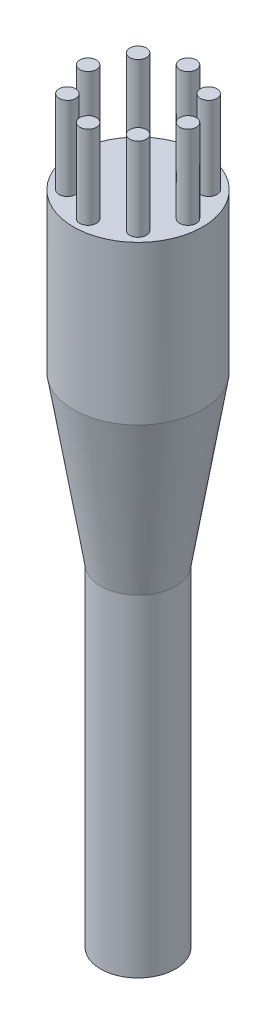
ISO-10303-21;
HEADER;
FILE_DESCRIPTION(('STEP AP214'),'2;1');
FILE_NAME('part.step','',(''),(''),'','','');
FILE_SCHEMA(('AUTOMOTIVE_DESIGN { 1 0 10303 214 1 1 1 1 }'));
ENDSEC;
DATA;
#1=APPLICATION_CONTEXT('core data for automotive mechanical design processes');
#2=APPLICATION_PROTOCOL_DEFINITION('international standard','automotive_design',2000,#1);
#3=PRODUCT_CONTEXT('',#1,'mechanical');
#4=PRODUCT('Part','Part','',(#3));
#5=PRODUCT_RELATED_PRODUCT_CATEGORY('part','',(#4));
#6=PRODUCT_DEFINITION_FORMATION('','',#4);
#7=PRODUCT_DEFINITION_CONTEXT('part definition',#1,'design');
#8=PRODUCT_DEFINITION('design','',#6,#7);
#9=PRODUCT_DEFINITION_SHAPE('','',#8);
#10=(LENGTH_UNIT() NAMED_UNIT(*) SI_UNIT(.MILLI.,.METRE.));
#11=(NAMED_UNIT(*) PLANE_ANGLE_UNIT() SI_UNIT($,.RADIAN.));
#12=(NAMED_UNIT(*) SI_UNIT($,.STERADIAN.) SOLID_ANGLE_UNIT());
#13=UNCERTAINTY_MEASURE_WITH_UNIT(LENGTH_MEASURE(1.E-05),#10,'distance_accuracy_value','');
#14=(GEOMETRIC_REPRESENTATION_CONTEXT(3) GLOBAL_UNCERTAINTY_ASSIGNED_CONTEXT((#13)) GLOBAL_UNIT_ASSIGNED_CONTEXT((#10,
#11,#12)) REPRESENTATION_CONTEXT('',''));
#15=CARTESIAN_POINT('',(0.,0.,0.));
#16=DIRECTION('',(0.,0.,1.));
#17=DIRECTION('',(1.,0.,0.));
#18=AXIS2_PLACEMENT_3D('',#15,#16,#17);
#19=CARTESIAN_POINT('',(-7.07767178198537E-13,18.9999999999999,-6.22765727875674E-13));
#20=DIRECTION('',(0.,0.999999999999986,0.));
#21=DIRECTION('',(0.,0.,0.999999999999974));
#22=AXIS2_PLACEMENT_3D('',#19,#20,#21);
#23=PLANE('',#22);
#24=CARTESIAN_POINT('',(-6.00000000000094,18.9999999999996,-1.71737624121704E-13));
#25=DIRECTION('',(0.,0.999999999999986,0.));
#26=DIRECTION('',(0.999999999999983,0.,0.));
#27=AXIS2_PLACEMENT_3D('',#24,#25,#26);
#28=CIRCLE('',#27,1.);
#29=CARTESIAN_POINT('',(-6.00000000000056,18.9999999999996,-0.999999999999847));
#30=VERTEX_POINT('',#29);
#31=EDGE_CURVE('E82',#30,#30,#28,.T.);
#32=ORIENTED_EDGE('',*,*,#31,.F.);
#33=EDGE_LOOP('',(#32));
#34=FACE_BOUND('',#33,.T.);
#35=CARTESIAN_POINT('',(-5.96744875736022E-13,18.9999999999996,5.99999999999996));
#36=DIRECTION('',(0.,0.999999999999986,0.));
#37=DIRECTION('',(0.,0.,-0.999999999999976));
#38=AXIS2_PLACEMENT_3D('',#35,#36,#37);
#39=CIRCLE('',#38,1.);
#40=CARTESIAN_POINT('',(-1.03295150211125E-12,18.9999999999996,4.99999999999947));
#41=VERTEX_POINT('',#40);
#42=EDGE_CURVE('E70',#41,#41,#39,.T.);
#43=ORIENTED_EDGE('',*,*,#42,.F.);
#44=EDGE_LOOP('',(#43));
#45=FACE_BOUND('',#44,.T.);
#46=CARTESIAN_POINT('',(5.99999999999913,18.9999999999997,0.));
#47=DIRECTION('',(0.,0.999999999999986,0.));
#48=DIRECTION('',(-0.999999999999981,0.,0.));
#49=AXIS2_PLACEMENT_3D('',#46,#47,#48);
#50=CIRCLE('',#49,1.);
#51=CARTESIAN_POINT('',(5.99999999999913,18.9999999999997,-1.00000000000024));
#52=VERTEX_POINT('',#51);
#53=EDGE_CURVE('E58',#52,#52,#50,.T.);
#54=ORIENTED_EDGE('',*,*,#53,.F.);
#55=EDGE_LOOP('',(#54));
#56=FACE_BOUND('',#55,.T.);
#57=CARTESIAN_POINT('',(-6.59194920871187E-13,18.9999999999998,-6.00000000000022));
#58=DIRECTION('',(0.,0.999999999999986,0.));
#59=DIRECTION('',(0.,0.,0.999999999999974));
#60=AXIS2_PLACEMENT_3D('',#57,#58,#59);
#61=CIRCLE('',#60,1.);
#62=CARTESIAN_POINT('',(-6.30495655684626E-13,18.9999999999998,-7.00000000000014));
#63=VERTEX_POINT('',#62);
#64=EDGE_CURVE('E43',#63,#63,#61,.T.);
#65=ORIENTED_EDGE('',*,*,#64,.F.);
#66=EDGE_LOOP('',(#65));
#67=FACE_BOUND('',#66,.T.);
#68=CARTESIAN_POINT('',(-7.07767178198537E-13,18.9999999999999,-6.22765727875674E-13));
#69=DIRECTION('',(0.,0.999999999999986,0.));
#70=DIRECTION('',(0.,0.,0.999999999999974));
#71=AXIS2_PLACEMENT_3D('',#68,#69,#70);
#72=CIRCLE('',#71,7.75);
#73=CARTESIAN_POINT('',(-7.43474726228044E-13,18.9999999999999,-7.75000000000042));
#74=VERTEX_POINT('',#73);
#75=EDGE_CURVE('E10',#74,#74,#72,.T.);
#76=ORIENTED_EDGE('',*,*,#75,.T.);
#77=EDGE_LOOP('',(#76));
#78=FACE_BOUND('',#77,.T.);
#79=CARTESIAN_POINT('',(4.24264068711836,18.9999999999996,-4.24264068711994));
#80=DIRECTION('',(0.,0.999999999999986,0.));
#81=DIRECTION('',(-0.707106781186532,0.,0.707106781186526));
#82=AXIS2_PLACEMENT_3D('',#79,#80,#81);
#83=CIRCLE('',#82,1.);
#84=CARTESIAN_POINT('',(4.24264068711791,18.9999999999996,-5.24264068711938));
#85=VERTEX_POINT('',#84);
#86=EDGE_CURVE('E52',#85,#85,#83,.T.);
#87=ORIENTED_EDGE('',*,*,#86,.F.);
#88=EDGE_LOOP('',(#87));
#89=FACE_BOUND('',#88,.T.);
#90=CARTESIAN_POINT('',(4.24264068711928,18.9999999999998,4.24264068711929));
#91=DIRECTION('',(0.,0.999999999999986,0.));
#92=DIRECTION('',(-0.707106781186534,0.,-0.707106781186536));
#93=AXIS2_PLACEMENT_3D('',#90,#91,#92);
#94=CIRCLE('',#93,1.);
#95=CARTESIAN_POINT('',(4.24264068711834,18.9999999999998,3.24264068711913));
#96=VERTEX_POINT('',#95);
#97=EDGE_CURVE('E64',#96,#96,#94,.T.);
#98=ORIENTED_EDGE('',*,*,#97,.F.);
#99=EDGE_LOOP('',(#98));
#100=FACE_BOUND('',#99,.T.);
#101=CARTESIAN_POINT('',(-4.24264068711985,18.9999999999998,4.24264068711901));
#102=DIRECTION('',(0.,0.999999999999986,0.));
#103=DIRECTION('',(0.707106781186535,0.,-0.707106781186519));
#104=AXIS2_PLACEMENT_3D('',#101,#102,#103);
#105=CIRCLE('',#104,1.);
#106=CARTESIAN_POINT('',(-4.24264068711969,18.9999999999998,3.24264068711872));
#107=VERTEX_POINT('',#106);
#108=EDGE_CURVE('E76',#107,#107,#105,.T.);
#109=ORIENTED_EDGE('',*,*,#108,.F.);
#110=EDGE_LOOP('',(#109));
#111=FACE_BOUND('',#110,.T.);
#112=CARTESIAN_POINT('',(-4.24264068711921,18.9999999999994,-4.24264068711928));
#113=DIRECTION('',(0.,0.999999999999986,0.));
#114=DIRECTION('',(0.707106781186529,0.,0.707106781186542));
#115=AXIS2_PLACEMENT_3D('',#112,#113,#114);
#116=CIRCLE('',#115,1.);
#117=CARTESIAN_POINT('',(-4.24264068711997,18.9999999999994,-5.24264068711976));
#118=VERTEX_POINT('',#117);
#119=EDGE_CURVE('E88',#118,#118,#116,.T.);
#120=ORIENTED_EDGE('',*,*,#119,.F.);
#121=EDGE_LOOP('',(#120));
#122=FACE_BOUND('',#121,.T.);
#123=ADVANCED_FACE('F32',(#34,#45,#56,#67,#78,#89,#100,#111,#122),#23,.T.);
#124=CARTESIAN_POINT('',(-7.07767178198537E-13,18.9999999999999,-6.22765727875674E-13));
#125=DIRECTION('',(0.,-0.999999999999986,0.));
#126=DIRECTION('',(0.,0.,-0.999999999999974));
#127=AXIS2_PLACEMENT_3D('',#124,#125,#126);
#128=CYLINDRICAL_SURFACE('',#127,7.75);
#129=CARTESIAN_POINT('',(0.,0.,0.));
#130=DIRECTION('',(0.,0.999999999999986,0.));
#131=DIRECTION('',(0.,0.,0.999999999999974));
#132=AXIS2_PLACEMENT_3D('',#129,#130,#131);
#133=CIRCLE('',#132,7.75);
#134=CARTESIAN_POINT('',(-7.856632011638E-13,0.,-7.75000000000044));
#135=VERTEX_POINT('',#134);
#136=EDGE_CURVE('E97',#135,#135,#133,.T.);
#137=CARTESIAN_POINT('',(-7.43474726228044E-13,18.9999999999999,-7.75000000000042));
#138=CARTESIAN_POINT('',(-7.43914189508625E-13,18.8020833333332,-7.75000000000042));
#139=CARTESIAN_POINT('',(-7.44353652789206E-13,18.6041666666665,-7.75000000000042));
#140=CARTESIAN_POINT('',(-7.45232579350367E-13,18.2083333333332,-7.75000000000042));
#141=CARTESIAN_POINT('',(-7.45672042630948E-13,18.0104166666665,-7.75000000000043));
#142=CARTESIAN_POINT('',(-7.46550969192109E-13,17.6145833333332,-7.75000000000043));
#143=CARTESIAN_POINT('',(-7.4699043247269E-13,17.4166666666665,-7.75000000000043));
#144=CARTESIAN_POINT('',(-7.47869359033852E-13,17.0208333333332,-7.75000000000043));
#145=CARTESIAN_POINT('',(-7.48308822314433E-13,16.8229166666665,-7.75000000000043));
#146=CARTESIAN_POINT('',(-7.49187748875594E-13,16.4270833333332,-7.75000000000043));
#147=CARTESIAN_POINT('',(-7.49627212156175E-13,16.2291666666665,-7.75000000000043));
#148=CARTESIAN_POINT('',(-7.50506138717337E-13,15.8333333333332,-7.75000000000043));
#149=CARTESIAN_POINT('',(-7.50945601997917E-13,15.6354166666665,-7.75000000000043));
#150=CARTESIAN_POINT('',(-7.51824528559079E-13,15.2395833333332,-7.75000000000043));
#151=CARTESIAN_POINT('',(-7.5226399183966E-13,15.0416666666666,-7.75000000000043));
#152=CARTESIAN_POINT('',(-7.53142918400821E-13,14.6458333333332,-7.75000000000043));
#153=CARTESIAN_POINT('',(-7.53582381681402E-13,14.4479166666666,-7.75000000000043));
#154=CARTESIAN_POINT('',(-7.54461308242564E-13,14.0520833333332,-7.75000000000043));
#155=CARTESIAN_POINT('',(-7.54900771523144E-13,13.8541666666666,-7.75000000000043));
#156=CARTESIAN_POINT('',(-7.55779698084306E-13,13.4583333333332,-7.75000000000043));
#157=CARTESIAN_POINT('',(-7.56219161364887E-13,13.2604166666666,-7.75000000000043));
#158=CARTESIAN_POINT('',(-7.57098087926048E-13,12.8645833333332,-7.75000000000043));
#159=CARTESIAN_POINT('',(-7.57537551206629E-13,12.6666666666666,-7.75000000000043));
#160=CARTESIAN_POINT('',(-7.58416477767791E-13,12.2708333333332,-7.75000000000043));
#161=CARTESIAN_POINT('',(-7.58855941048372E-13,12.0729166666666,-7.75000000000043));
#162=CARTESIAN_POINT('',(-7.59734867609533E-13,11.6770833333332,-7.75000000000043));
#163=CARTESIAN_POINT('',(-7.60174330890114E-13,11.4791666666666,-7.75000000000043));
#164=CARTESIAN_POINT('',(-7.61053257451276E-13,11.0833333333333,-7.75000000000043));
#165=CARTESIAN_POINT('',(-7.61492720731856E-13,10.8854166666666,-7.75000000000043));
#166=CARTESIAN_POINT('',(-7.62371647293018E-13,10.4895833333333,-7.75000000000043));
#167=CARTESIAN_POINT('',(-7.62811110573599E-13,10.2916666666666,-7.75000000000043));
#168=CARTESIAN_POINT('',(-7.6369003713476E-13,9.89583333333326,-7.75000000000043));
#169=CARTESIAN_POINT('',(-7.64129500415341E-13,9.6979166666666,-7.75000000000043));
#170=CARTESIAN_POINT('',(-7.65008426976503E-13,9.30208333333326,-7.75000000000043));
#171=CARTESIAN_POINT('',(-7.65447890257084E-13,9.1041666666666,-7.75000000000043));
#172=CARTESIAN_POINT('',(-7.66326816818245E-13,8.70833333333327,-7.75000000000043));
#173=CARTESIAN_POINT('',(-7.66766280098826E-13,8.5104166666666,-7.75000000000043));
#174=CARTESIAN_POINT('',(-7.67645206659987E-13,8.11458333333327,-7.75000000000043));
#175=CARTESIAN_POINT('',(-7.68084669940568E-13,7.91666666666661,-7.75000000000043));
#176=CARTESIAN_POINT('',(-7.6896359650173E-13,7.52083333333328,-7.75000000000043));
#177=CARTESIAN_POINT('',(-7.69403059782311E-13,7.32291666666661,-7.75000000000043));
#178=CARTESIAN_POINT('',(-7.70281986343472E-13,6.92708333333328,-7.75000000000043));
#179=CARTESIAN_POINT('',(-7.70721449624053E-13,6.72916666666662,-7.75000000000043));
#180=CARTESIAN_POINT('',(-7.71600376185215E-13,6.33333333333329,-7.75000000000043));
#181=CARTESIAN_POINT('',(-7.72039839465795E-13,6.13541666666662,-7.75000000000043));
#182=CARTESIAN_POINT('',(-7.72918766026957E-13,5.73958333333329,-7.75000000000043));
#183=CARTESIAN_POINT('',(-7.73358229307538E-13,5.54166666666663,-7.75000000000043));
#184=CARTESIAN_POINT('',(-7.74237155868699E-13,5.1458333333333,-7.75000000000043));
#185=CARTESIAN_POINT('',(-7.7467661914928E-13,4.94791666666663,-7.75000000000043));
#186=CARTESIAN_POINT('',(-7.75555545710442E-13,4.5520833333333,-7.75000000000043));
#187=CARTESIAN_POINT('',(-7.75995008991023E-13,4.35416666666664,-7.75000000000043));
#188=CARTESIAN_POINT('',(-7.76873935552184E-13,3.95833333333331,-7.75000000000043));
#189=CARTESIAN_POINT('',(-7.77313398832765E-13,3.76041666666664,-7.75000000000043));
#190=CARTESIAN_POINT('',(-7.78192325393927E-13,3.36458333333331,-7.75000000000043));
#191=CARTESIAN_POINT('',(-7.78631788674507E-13,3.16666666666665,-7.75000000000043));
#192=CARTESIAN_POINT('',(-7.79510715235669E-13,2.77083333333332,-7.75000000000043));
#193=CARTESIAN_POINT('',(-7.7995017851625E-13,2.57291666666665,-7.75000000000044));
#194=CARTESIAN_POINT('',(-7.80829105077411E-13,2.17708333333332,-7.75000000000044));
#195=CARTESIAN_POINT('',(-7.81268568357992E-13,1.97916666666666,-7.75000000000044));
#196=CARTESIAN_POINT('',(-7.82147494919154E-13,1.58333333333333,-7.75000000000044));
#197=CARTESIAN_POINT('',(-7.82586958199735E-13,1.38541666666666,-7.75000000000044));
#198=CARTESIAN_POINT('',(-7.83465884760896E-13,0.989583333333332,-7.75000000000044));
#199=CARTESIAN_POINT('',(-7.83905348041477E-13,0.791666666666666,-7.75000000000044));
#200=CARTESIAN_POINT('',(-7.84784274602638E-13,0.395833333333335,-7.75000000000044));
#201=CARTESIAN_POINT('',(-7.85223737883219E-13,0.197916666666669,-7.75000000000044));
#202=CARTESIAN_POINT('',(-7.856632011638E-13,0.,-7.75000000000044));
#203=B_SPLINE_CURVE_WITH_KNOTS('',3,(#137,#138,#139,#140,#141,#142,#143,#144,#145,#146,#147,
#148,#149,#150,#151,#152,#153,#154,#155,#156,#157,#158,#159,#160,#161,#162,#163,#164,#165,#166,
#167,#168,#169,#170,#171,#172,#173,#174,#175,#176,#177,#178,#179,#180,#181,#182,#183,#184,#185,
#186,#187,#188,#189,#190,#191,#192,#193,#194,#195,#196,#197,#198,#199,#200,#201,#202),
.UNSPECIFIED.,.F.,.F.,(4,2,2,2,2,2,2,2,2,2,2,2,2,2,2,2,2,2,2,2,2,2,2,2,2,2,2,2,2,2,2,2,4),(0.,
0.593749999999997,1.18749999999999,1.78124999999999,2.37499999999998,2.96874999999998,
3.56249999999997,4.15624999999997,4.74999999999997,5.34374999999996,5.93749999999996,
6.53124999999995,7.12499999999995,7.71874999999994,8.31249999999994,8.90624999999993,
9.49999999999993,10.0937499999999,10.6874999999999,11.2812499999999,11.8749999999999,
12.4687499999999,13.0624999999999,13.6562499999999,14.2499999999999,14.8437499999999,
15.4374999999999,16.0312499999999,16.6249999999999,17.2187499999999,17.8124999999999,
18.4062499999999,18.9999999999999),.UNSPECIFIED.);
#204=EDGE_CURVE('BSEAM34',#74,#135,#203,.T.);
#205=ORIENTED_EDGE('',*,*,#75,.F.);
#206=ORIENTED_EDGE('',*,*,#136,.T.);
#207=ORIENTED_EDGE('',*,*,#204,.T.);
#208=ORIENTED_EDGE('',*,*,#204,.F.);
#209=EDGE_LOOP('',(#205,#207,#206,#208));
#210=FACE_BOUND('',#209,.T.);
#211=ADVANCED_FACE('F34',(#210),#128,.T.);
#212=CARTESIAN_POINT('',(-6.03683769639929E-13,28.9999999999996,-6.00000000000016));
#213=DIRECTION('',(0.,-0.999999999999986,0.));
#214=DIRECTION('',(0.,0.,-0.999999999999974));
#215=AXIS2_PLACEMENT_3D('',#212,#213,#214);
#216=CYLINDRICAL_SURFACE('',#215,1.);
#217=CARTESIAN_POINT('',(-6.03683769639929E-13,28.9999999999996,-6.00000000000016));
#218=DIRECTION('',(0.,0.999999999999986,0.));
#219=DIRECTION('',(0.,0.,0.999999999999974));
#220=AXIS2_PLACEMENT_3D('',#217,#218,#219);
#221=CIRCLE('',#220,1.);
#222=CARTESIAN_POINT('',(-6.08291195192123E-13,28.9999999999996,-7.00000000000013));
#223=VERTEX_POINT('',#222);
#224=EDGE_CURVE('E39',#223,#223,#221,.T.);
#225=CARTESIAN_POINT('',(-6.08291195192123E-13,28.9999999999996,-7.00000000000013));
#226=CARTESIAN_POINT('',(-6.08522491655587E-13,28.895833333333,-7.00000000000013));
#227=CARTESIAN_POINT('',(-6.0875378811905E-13,28.7916666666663,-7.00000000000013));
#228=CARTESIAN_POINT('',(-6.09216381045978E-13,28.583333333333,-7.00000000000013));
#229=CARTESIAN_POINT('',(-6.09447677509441E-13,28.4791666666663,-7.00000000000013));
#230=CARTESIAN_POINT('',(-6.09910270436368E-13,28.270833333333,-7.00000000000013));
#231=CARTESIAN_POINT('',(-6.10141566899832E-13,28.1666666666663,-7.00000000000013));
#232=CARTESIAN_POINT('',(-6.10604159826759E-13,27.958333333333,-7.00000000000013));
#233=CARTESIAN_POINT('',(-6.10835456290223E-13,27.8541666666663,-7.00000000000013));
#234=CARTESIAN_POINT('',(-6.1129804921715E-13,27.645833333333,-7.00000000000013));
#235=CARTESIAN_POINT('',(-6.11529345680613E-13,27.5416666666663,-7.00000000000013));
#236=CARTESIAN_POINT('',(-6.1199193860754E-13,27.333333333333,-7.00000000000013));
#237=CARTESIAN_POINT('',(-6.12223235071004E-13,27.2291666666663,-7.00000000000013));
#238=CARTESIAN_POINT('',(-6.12685827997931E-13,27.020833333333,-7.00000000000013));
#239=CARTESIAN_POINT('',(-6.12917124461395E-13,26.9166666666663,-7.00000000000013));
#240=CARTESIAN_POINT('',(-6.13379717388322E-13,26.708333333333,-7.00000000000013));
#241=CARTESIAN_POINT('',(-6.13611013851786E-13,26.6041666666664,-7.00000000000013));
#242=CARTESIAN_POINT('',(-6.14073606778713E-13,26.395833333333,-7.00000000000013));
#243=CARTESIAN_POINT('',(-6.14304903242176E-13,26.2916666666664,-7.00000000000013));
#244=CARTESIAN_POINT('',(-6.14767496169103E-13,26.083333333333,-7.00000000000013));
#245=CARTESIAN_POINT('',(-6.14998792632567E-13,25.9791666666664,-7.00000000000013));
#246=CARTESIAN_POINT('',(-6.15461385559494E-13,25.770833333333,-7.00000000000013));
#247=CARTESIAN_POINT('',(-6.15692682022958E-13,25.6666666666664,-7.00000000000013));
#248=CARTESIAN_POINT('',(-6.16155274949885E-13,25.458333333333,-7.00000000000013));
#249=CARTESIAN_POINT('',(-6.16386571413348E-13,25.3541666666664,-7.00000000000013));
#250=CARTESIAN_POINT('',(-6.16849164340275E-13,25.145833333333,-7.00000000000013));
#251=CARTESIAN_POINT('',(-6.17080460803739E-13,25.0416666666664,-7.00000000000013));
#252=CARTESIAN_POINT('',(-6.17543053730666E-13,24.833333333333,-7.00000000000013));
#253=CARTESIAN_POINT('',(-6.1777435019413E-13,24.7291666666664,-7.00000000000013));
#254=CARTESIAN_POINT('',(-6.18236943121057E-13,24.5208333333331,-7.00000000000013));
#255=CARTESIAN_POINT('',(-6.1846823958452E-13,24.4166666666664,-7.00000000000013));
#256=CARTESIAN_POINT('',(-6.18930832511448E-13,24.2083333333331,-7.00000000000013));
#257=CARTESIAN_POINT('',(-6.19162128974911E-13,24.1041666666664,-7.00000000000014));
#258=CARTESIAN_POINT('',(-6.19624721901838E-13,23.8958333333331,-7.00000000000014));
#259=CARTESIAN_POINT('',(-6.19856018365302E-13,23.7916666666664,-7.00000000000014));
#260=CARTESIAN_POINT('',(-6.20318611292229E-13,23.5833333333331,-7.00000000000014));
#261=CARTESIAN_POINT('',(-6.20549907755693E-13,23.4791666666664,-7.00000000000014));
#262=CARTESIAN_POINT('',(-6.2101250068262E-13,23.2708333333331,-7.00000000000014));
#263=CARTESIAN_POINT('',(-6.21243797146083E-13,23.1666666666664,-7.00000000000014));
#264=CARTESIAN_POINT('',(-6.21706390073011E-13,22.9583333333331,-7.00000000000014));
#265=CARTESIAN_POINT('',(-6.21937686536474E-13,22.8541666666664,-7.00000000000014));
#266=CARTESIAN_POINT('',(-6.22400279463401E-13,22.6458333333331,-7.00000000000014));
#267=CARTESIAN_POINT('',(-6.22631575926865E-13,22.5416666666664,-7.00000000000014));
#268=CARTESIAN_POINT('',(-6.23094168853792E-13,22.3333333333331,-7.00000000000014));
#269=CARTESIAN_POINT('',(-6.23325465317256E-13,22.2291666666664,-7.00000000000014));
#270=CARTESIAN_POINT('',(-6.23788058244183E-13,22.0208333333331,-7.00000000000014));
#271=CARTESIAN_POINT('',(-6.24019354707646E-13,21.9166666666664,-7.00000000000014));
#272=CARTESIAN_POINT('',(-6.24481947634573E-13,21.7083333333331,-7.00000000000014));
#273=CARTESIAN_POINT('',(-6.24713244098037E-13,21.6041666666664,-7.00000000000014));
#274=CARTESIAN_POINT('',(-6.25175837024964E-13,21.3958333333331,-7.00000000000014));
#275=CARTESIAN_POINT('',(-6.25407133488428E-13,21.2916666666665,-7.00000000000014));
#276=CARTESIAN_POINT('',(-6.25869726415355E-13,21.0833333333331,-7.00000000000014));
#277=CARTESIAN_POINT('',(-6.26101022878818E-13,20.9791666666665,-7.00000000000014));
#278=CARTESIAN_POINT('',(-6.26563615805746E-13,20.7708333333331,-7.00000000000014));
#279=CARTESIAN_POINT('',(-6.26794912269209E-13,20.6666666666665,-7.00000000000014));
#280=CARTESIAN_POINT('',(-6.27257505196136E-13,20.4583333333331,-7.00000000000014));
#281=CARTESIAN_POINT('',(-6.274888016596E-13,20.3541666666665,-7.00000000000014));
#282=CARTESIAN_POINT('',(-6.27951394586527E-13,20.1458333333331,-7.00000000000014));
#283=CARTESIAN_POINT('',(-6.28182691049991E-13,20.0416666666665,-7.00000000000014));
#284=CARTESIAN_POINT('',(-6.28645283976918E-13,19.8333333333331,-7.00000000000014));
#285=CARTESIAN_POINT('',(-6.28876580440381E-13,19.7291666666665,-7.00000000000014));
#286=CARTESIAN_POINT('',(-6.29339173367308E-13,19.5208333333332,-7.00000000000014));
#287=CARTESIAN_POINT('',(-6.29570469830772E-13,19.4166666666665,-7.00000000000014));
#288=CARTESIAN_POINT('',(-6.30033062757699E-13,19.2083333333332,-7.00000000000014));
#289=CARTESIAN_POINT('',(-6.30264359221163E-13,19.1041666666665,-7.00000000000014));
#290=CARTESIAN_POINT('',(-6.30495655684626E-13,18.9999999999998,-7.00000000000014));
#291=B_SPLINE_CURVE_WITH_KNOTS('',3,(#225,#226,#227,#228,#229,#230,#231,#232,#233,#234,#235,
#236,#237,#238,#239,#240,#241,#242,#243,#244,#245,#246,#247,#248,#249,#250,#251,#252,#253,#254,
#255,#256,#257,#258,#259,#260,#261,#262,#263,#264,#265,#266,#267,#268,#269,#270,#271,#272,#273,
#274,#275,#276,#277,#278,#279,#280,#281,#282,#283,#284,#285,#286,#287,#288,#289,#290),
.UNSPECIFIED.,.F.,.F.,(4,2,2,2,2,2,2,2,2,2,2,2,2,2,2,2,2,2,2,2,2,2,2,2,2,2,2,2,2,2,2,2,4),(0.,
0.312499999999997,0.62499999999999,0.937499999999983,1.24999999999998,1.56249999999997,
1.87499999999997,2.18749999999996,2.49999999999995,2.81249999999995,3.12499999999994,
3.43749999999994,3.74999999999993,4.06249999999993,4.37499999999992,4.68749999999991,
4.99999999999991,5.3124999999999,5.6249999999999,5.93749999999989,6.24999999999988,
6.56249999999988,6.87499999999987,7.18749999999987,7.49999999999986,7.81249999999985,
8.12499999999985,8.43749999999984,8.74999999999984,9.06249999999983,9.37499999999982,
9.68749999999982,9.99999999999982),.UNSPECIFIED.);
#292=EDGE_CURVE('BSEAM118',#223,#63,#291,.T.);
#293=ORIENTED_EDGE('',*,*,#224,.F.);
#294=ORIENTED_EDGE('',*,*,#64,.T.);
#295=ORIENTED_EDGE('',*,*,#292,.T.);
#296=ORIENTED_EDGE('',*,*,#292,.F.);
#297=EDGE_LOOP('',(#293,#295,#294,#296));
#298=FACE_BOUND('',#297,.T.);
#299=ADVANCED_FACE('F118',(#298),#216,.T.);
#300=CARTESIAN_POINT('',(-6.03683769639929E-13,28.9999999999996,-6.00000000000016));
#301=DIRECTION('',(0.,0.999999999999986,0.));
#302=DIRECTION('',(0.,0.,0.999999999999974));
#303=AXIS2_PLACEMENT_3D('',#300,#301,#302);
#304=PLANE('',#303);
#305=ORIENTED_EDGE('',*,*,#224,.T.);
#306=EDGE_LOOP('',(#305));
#307=FACE_BOUND('',#306,.T.);
#308=ADVANCED_FACE('F125',(#307),#304,.T.);
#309=CARTESIAN_POINT('',(4.24264068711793,28.9999999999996,-4.2426406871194));
#310=DIRECTION('',(0.,-0.999999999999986,0.));
#311=DIRECTION('',(0.,0.,-0.999999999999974));
#312=AXIS2_PLACEMENT_3D('',#309,#310,#311);
#313=CYLINDRICAL_SURFACE('',#312,1.);
#314=CARTESIAN_POINT('',(4.24264068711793,28.9999999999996,-4.2426406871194));
#315=DIRECTION('',(0.,0.999999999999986,0.));
#316=DIRECTION('',(-0.707106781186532,0.,0.707106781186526));
#317=AXIS2_PLACEMENT_3D('',#314,#315,#316);
#318=CIRCLE('',#317,1.);
#319=CARTESIAN_POINT('',(4.24264068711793,28.9999999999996,-5.24264068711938));
#320=VERTEX_POINT('',#319);
#321=EDGE_CURVE('E47',#320,#320,#318,.T.);
#322=CARTESIAN_POINT('',(4.24264068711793,28.9999999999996,-5.24264068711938));
#323=CARTESIAN_POINT('',(4.24264068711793,28.8958333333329,-5.24264068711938));
#324=CARTESIAN_POINT('',(4.24264068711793,28.7916666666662,-5.24264068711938));
#325=CARTESIAN_POINT('',(4.24264068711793,28.5833333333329,-5.24264068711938));
#326=CARTESIAN_POINT('',(4.24264068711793,28.4791666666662,-5.24264068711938));
#327=CARTESIAN_POINT('',(4.24264068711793,28.2708333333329,-5.24264068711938));
#328=CARTESIAN_POINT('',(4.24264068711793,28.1666666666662,-5.24264068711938));
#329=CARTESIAN_POINT('',(4.24264068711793,27.9583333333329,-5.24264068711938));
#330=CARTESIAN_POINT('',(4.24264068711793,27.8541666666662,-5.24264068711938));
#331=CARTESIAN_POINT('',(4.24264068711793,27.6458333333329,-5.24264068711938));
#332=CARTESIAN_POINT('',(4.24264068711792,27.5416666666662,-5.24264068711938));
#333=CARTESIAN_POINT('',(4.24264068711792,27.3333333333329,-5.24264068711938));
#334=CARTESIAN_POINT('',(4.24264068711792,27.2291666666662,-5.24264068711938));
#335=CARTESIAN_POINT('',(4.24264068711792,27.0208333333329,-5.24264068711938));
#336=CARTESIAN_POINT('',(4.24264068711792,26.9166666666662,-5.24264068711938));
#337=CARTESIAN_POINT('',(4.24264068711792,26.7083333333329,-5.24264068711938));
#338=CARTESIAN_POINT('',(4.24264068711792,26.6041666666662,-5.24264068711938));
#339=CARTESIAN_POINT('',(4.24264068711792,26.3958333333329,-5.24264068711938));
#340=CARTESIAN_POINT('',(4.24264068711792,26.2916666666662,-5.24264068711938));
#341=CARTESIAN_POINT('',(4.24264068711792,26.0833333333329,-5.24264068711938));
#342=CARTESIAN_POINT('',(4.24264068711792,25.9791666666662,-5.24264068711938));
#343=CARTESIAN_POINT('',(4.24264068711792,25.7708333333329,-5.24264068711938));
#344=CARTESIAN_POINT('',(4.24264068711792,25.6666666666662,-5.24264068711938));
#345=CARTESIAN_POINT('',(4.24264068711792,25.4583333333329,-5.24264068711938));
#346=CARTESIAN_POINT('',(4.24264068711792,25.3541666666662,-5.24264068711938));
#347=CARTESIAN_POINT('',(4.24264068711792,25.1458333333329,-5.24264068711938));
#348=CARTESIAN_POINT('',(4.24264068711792,25.0416666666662,-5.24264068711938));
#349=CARTESIAN_POINT('',(4.24264068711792,24.8333333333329,-5.24264068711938));
#350=CARTESIAN_POINT('',(4.24264068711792,24.7291666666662,-5.24264068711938));
#351=CARTESIAN_POINT('',(4.24264068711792,24.5208333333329,-5.24264068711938));
#352=CARTESIAN_POINT('',(4.24264068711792,24.4166666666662,-5.24264068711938));
#353=CARTESIAN_POINT('',(4.24264068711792,24.2083333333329,-5.24264068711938));
#354=CARTESIAN_POINT('',(4.24264068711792,24.1041666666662,-5.24264068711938));
#355=CARTESIAN_POINT('',(4.24264068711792,23.8958333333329,-5.24264068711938));
#356=CARTESIAN_POINT('',(4.24264068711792,23.7916666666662,-5.24264068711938));
#357=CARTESIAN_POINT('',(4.24264068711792,23.5833333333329,-5.24264068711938));
#358=CARTESIAN_POINT('',(4.24264068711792,23.4791666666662,-5.24264068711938));
#359=CARTESIAN_POINT('',(4.24264068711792,23.2708333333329,-5.24264068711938));
#360=CARTESIAN_POINT('',(4.24264068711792,23.1666666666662,-5.24264068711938));
#361=CARTESIAN_POINT('',(4.24264068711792,22.9583333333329,-5.24264068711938));
#362=CARTESIAN_POINT('',(4.24264068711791,22.8541666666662,-5.24264068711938));
#363=CARTESIAN_POINT('',(4.24264068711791,22.6458333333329,-5.24264068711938));
#364=CARTESIAN_POINT('',(4.24264068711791,22.5416666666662,-5.24264068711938));
#365=CARTESIAN_POINT('',(4.24264068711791,22.3333333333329,-5.24264068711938));
#366=CARTESIAN_POINT('',(4.24264068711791,22.2291666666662,-5.24264068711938));
#367=CARTESIAN_POINT('',(4.24264068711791,22.0208333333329,-5.24264068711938));
#368=CARTESIAN_POINT('',(4.24264068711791,21.9166666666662,-5.24264068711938));
#369=CARTESIAN_POINT('',(4.24264068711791,21.7083333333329,-5.24264068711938));
#370=CARTESIAN_POINT('',(4.24264068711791,21.6041666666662,-5.24264068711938));
#371=CARTESIAN_POINT('',(4.24264068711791,21.3958333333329,-5.24264068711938));
#372=CARTESIAN_POINT('',(4.24264068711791,21.2916666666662,-5.24264068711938));
#373=CARTESIAN_POINT('',(4.24264068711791,21.0833333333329,-5.24264068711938));
#374=CARTESIAN_POINT('',(4.24264068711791,20.9791666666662,-5.24264068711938));
#375=CARTESIAN_POINT('',(4.24264068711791,20.7708333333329,-5.24264068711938));
#376=CARTESIAN_POINT('',(4.24264068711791,20.6666666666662,-5.24264068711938));
#377=CARTESIAN_POINT('',(4.24264068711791,20.4583333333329,-5.24264068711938));
#378=CARTESIAN_POINT('',(4.24264068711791,20.3541666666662,-5.24264068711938));
#379=CARTESIAN_POINT('',(4.24264068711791,20.1458333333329,-5.24264068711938));
#380=CARTESIAN_POINT('',(4.24264068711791,20.0416666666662,-5.24264068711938));
#381=CARTESIAN_POINT('',(4.24264068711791,19.8333333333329,-5.24264068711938));
#382=CARTESIAN_POINT('',(4.24264068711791,19.7291666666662,-5.24264068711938));
#383=CARTESIAN_POINT('',(4.24264068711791,19.5208333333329,-5.24264068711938));
#384=CARTESIAN_POINT('',(4.24264068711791,19.4166666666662,-5.24264068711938));
#385=CARTESIAN_POINT('',(4.24264068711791,19.2083333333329,-5.24264068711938));
#386=CARTESIAN_POINT('',(4.24264068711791,19.1041666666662,-5.24264068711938));
#387=CARTESIAN_POINT('',(4.24264068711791,18.9999999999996,-5.24264068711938));
#388=B_SPLINE_CURVE_WITH_KNOTS('',3,(#322,#323,#324,#325,#326,#327,#328,#329,#330,#331,#332,
#333,#334,#335,#336,#337,#338,#339,#340,#341,#342,#343,#344,#345,#346,#347,#348,#349,#350,#351,
#352,#353,#354,#355,#356,#357,#358,#359,#360,#361,#362,#363,#364,#365,#366,#367,#368,#369,#370,
#371,#372,#373,#374,#375,#376,#377,#378,#379,#380,#381,#382,#383,#384,#385,#386,#387),
.UNSPECIFIED.,.F.,.F.,(4,2,2,2,2,2,2,2,2,2,2,2,2,2,2,2,2,2,2,2,2,2,2,2,2,2,2,2,2,2,2,2,4),(0.,
0.3125,0.625000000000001,0.937500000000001,1.25,1.5625,1.875,2.1875,2.5,2.8125,3.125,3.4375,
3.74999999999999,4.06249999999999,4.37499999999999,4.68749999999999,4.99999999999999,
5.31249999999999,5.62499999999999,5.93749999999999,6.24999999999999,6.56249999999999,
6.87499999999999,7.18749999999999,7.49999999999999,7.81249999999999,8.12499999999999,
8.43749999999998,8.74999999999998,9.06249999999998,9.37499999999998,9.68749999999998,
9.99999999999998),.UNSPECIFIED.);
#389=EDGE_CURVE('BSEAM129',#320,#85,#388,.T.);
#390=ORIENTED_EDGE('',*,*,#321,.F.);
#391=ORIENTED_EDGE('',*,*,#86,.T.);
#392=ORIENTED_EDGE('',*,*,#389,.T.);
#393=ORIENTED_EDGE('',*,*,#389,.F.);
#394=EDGE_LOOP('',(#390,#392,#391,#393));
#395=FACE_BOUND('',#394,.T.);
#396=ADVANCED_FACE('F129',(#395),#313,.T.);
#397=CARTESIAN_POINT('',(4.24264068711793,28.9999999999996,-4.2426406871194));
#398=DIRECTION('',(0.,0.999999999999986,0.));
#399=DIRECTION('',(-0.707106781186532,0.,0.707106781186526));
#400=AXIS2_PLACEMENT_3D('',#397,#398,#399);
#401=PLANE('',#400);
#402=ORIENTED_EDGE('',*,*,#321,.T.);
#403=EDGE_LOOP('',(#402));
#404=FACE_BOUND('',#403,.T.);
#405=ADVANCED_FACE('F132',(#404),#401,.T.);
#406=CARTESIAN_POINT('',(5.99999999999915,28.9999999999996,-2.55004350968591E-13));
#407=DIRECTION('',(0.,-0.999999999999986,0.));
#408=DIRECTION('',(0.,0.,-0.999999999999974));
#409=AXIS2_PLACEMENT_3D('',#406,#407,#408);
#410=CYLINDRICAL_SURFACE('',#409,1.);
#411=CARTESIAN_POINT('',(5.99999999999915,28.9999999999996,-2.55004350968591E-13));
#412=DIRECTION('',(0.,0.999999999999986,0.));
#413=DIRECTION('',(-0.999999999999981,0.,0.));
#414=AXIS2_PLACEMENT_3D('',#411,#412,#413);
#415=CIRCLE('',#414,1.);
#416=CARTESIAN_POINT('',(5.99999999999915,28.9999999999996,-1.00000000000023));
#417=VERTEX_POINT('',#416);
#418=EDGE_CURVE('E55',#417,#417,#415,.T.);
#419=CARTESIAN_POINT('',(5.99999999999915,28.9999999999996,-1.00000000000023));
#420=CARTESIAN_POINT('',(5.99999999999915,28.8958333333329,-1.00000000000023));
#421=CARTESIAN_POINT('',(5.99999999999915,28.7916666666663,-1.00000000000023));
#422=CARTESIAN_POINT('',(5.99999999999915,28.5833333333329,-1.00000000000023));
#423=CARTESIAN_POINT('',(5.99999999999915,28.4791666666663,-1.00000000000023));
#424=CARTESIAN_POINT('',(5.99999999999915,28.2708333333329,-1.00000000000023));
#425=CARTESIAN_POINT('',(5.99999999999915,28.1666666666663,-1.00000000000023));
#426=CARTESIAN_POINT('',(5.99999999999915,27.9583333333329,-1.00000000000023));
#427=CARTESIAN_POINT('',(5.99999999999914,27.8541666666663,-1.00000000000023));
#428=CARTESIAN_POINT('',(5.99999999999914,27.6458333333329,-1.00000000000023));
#429=CARTESIAN_POINT('',(5.99999999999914,27.5416666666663,-1.00000000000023));
#430=CARTESIAN_POINT('',(5.99999999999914,27.3333333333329,-1.00000000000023));
#431=CARTESIAN_POINT('',(5.99999999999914,27.2291666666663,-1.00000000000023));
#432=CARTESIAN_POINT('',(5.99999999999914,27.0208333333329,-1.00000000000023));
#433=CARTESIAN_POINT('',(5.99999999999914,26.9166666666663,-1.00000000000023));
#434=CARTESIAN_POINT('',(5.99999999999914,26.7083333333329,-1.00000000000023));
#435=CARTESIAN_POINT('',(5.99999999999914,26.6041666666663,-1.00000000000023));
#436=CARTESIAN_POINT('',(5.99999999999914,26.3958333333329,-1.00000000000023));
#437=CARTESIAN_POINT('',(5.99999999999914,26.2916666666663,-1.00000000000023));
#438=CARTESIAN_POINT('',(5.99999999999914,26.0833333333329,-1.00000000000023));
#439=CARTESIAN_POINT('',(5.99999999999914,25.9791666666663,-1.00000000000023));
#440=CARTESIAN_POINT('',(5.99999999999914,25.770833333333,-1.00000000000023));
#441=CARTESIAN_POINT('',(5.99999999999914,25.6666666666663,-1.00000000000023));
#442=CARTESIAN_POINT('',(5.99999999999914,25.458333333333,-1.00000000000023));
#443=CARTESIAN_POINT('',(5.99999999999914,25.3541666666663,-1.00000000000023));
#444=CARTESIAN_POINT('',(5.99999999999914,25.145833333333,-1.00000000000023));
#445=CARTESIAN_POINT('',(5.99999999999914,25.0416666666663,-1.00000000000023));
#446=CARTESIAN_POINT('',(5.99999999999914,24.833333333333,-1.00000000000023));
#447=CARTESIAN_POINT('',(5.99999999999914,24.7291666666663,-1.00000000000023));
#448=CARTESIAN_POINT('',(5.99999999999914,24.520833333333,-1.00000000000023));
#449=CARTESIAN_POINT('',(5.99999999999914,24.4166666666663,-1.00000000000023));
#450=CARTESIAN_POINT('',(5.99999999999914,24.208333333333,-1.00000000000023));
#451=CARTESIAN_POINT('',(5.99999999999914,24.1041666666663,-1.00000000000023));
#452=CARTESIAN_POINT('',(5.99999999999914,23.895833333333,-1.00000000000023));
#453=CARTESIAN_POINT('',(5.99999999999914,23.7916666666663,-1.00000000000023));
#454=CARTESIAN_POINT('',(5.99999999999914,23.583333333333,-1.00000000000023));
#455=CARTESIAN_POINT('',(5.99999999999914,23.4791666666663,-1.00000000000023));
#456=CARTESIAN_POINT('',(5.99999999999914,23.270833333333,-1.00000000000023));
#457=CARTESIAN_POINT('',(5.99999999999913,23.1666666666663,-1.00000000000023));
#458=CARTESIAN_POINT('',(5.99999999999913,22.958333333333,-1.00000000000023));
#459=CARTESIAN_POINT('',(5.99999999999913,22.8541666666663,-1.00000000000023));
#460=CARTESIAN_POINT('',(5.99999999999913,22.645833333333,-1.00000000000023));
#461=CARTESIAN_POINT('',(5.99999999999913,22.5416666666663,-1.00000000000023));
#462=CARTESIAN_POINT('',(5.99999999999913,22.333333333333,-1.00000000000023));
#463=CARTESIAN_POINT('',(5.99999999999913,22.2291666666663,-1.00000000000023));
#464=CARTESIAN_POINT('',(5.99999999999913,22.020833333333,-1.00000000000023));
#465=CARTESIAN_POINT('',(5.99999999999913,21.9166666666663,-1.00000000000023));
#466=CARTESIAN_POINT('',(5.99999999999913,21.708333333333,-1.00000000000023));
#467=CARTESIAN_POINT('',(5.99999999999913,21.6041666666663,-1.00000000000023));
#468=CARTESIAN_POINT('',(5.99999999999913,21.395833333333,-1.00000000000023));
#469=CARTESIAN_POINT('',(5.99999999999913,21.2916666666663,-1.00000000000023));
#470=CARTESIAN_POINT('',(5.99999999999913,21.083333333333,-1.00000000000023));
#471=CARTESIAN_POINT('',(5.99999999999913,20.9791666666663,-1.00000000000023));
#472=CARTESIAN_POINT('',(5.99999999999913,20.770833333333,-1.00000000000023));
#473=CARTESIAN_POINT('',(5.99999999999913,20.6666666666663,-1.00000000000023));
#474=CARTESIAN_POINT('',(5.99999999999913,20.458333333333,-1.00000000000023));
#475=CARTESIAN_POINT('',(5.99999999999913,20.3541666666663,-1.00000000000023));
#476=CARTESIAN_POINT('',(5.99999999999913,20.145833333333,-1.00000000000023));
#477=CARTESIAN_POINT('',(5.99999999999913,20.0416666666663,-1.00000000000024));
#478=CARTESIAN_POINT('',(5.99999999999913,19.833333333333,-1.00000000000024));
#479=CARTESIAN_POINT('',(5.99999999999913,19.7291666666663,-1.00000000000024));
#480=CARTESIAN_POINT('',(5.99999999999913,19.520833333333,-1.00000000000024));
#481=CARTESIAN_POINT('',(5.99999999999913,19.4166666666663,-1.00000000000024));
#482=CARTESIAN_POINT('',(5.99999999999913,19.208333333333,-1.00000000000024));
#483=CARTESIAN_POINT('',(5.99999999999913,19.1041666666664,-1.00000000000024));
#484=CARTESIAN_POINT('',(5.99999999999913,18.9999999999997,-1.00000000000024));
#485=B_SPLINE_CURVE_WITH_KNOTS('',3,(#419,#420,#421,#422,#423,#424,#425,#426,#427,#428,#429,
#430,#431,#432,#433,#434,#435,#436,#437,#438,#439,#440,#441,#442,#443,#444,#445,#446,#447,#448,
#449,#450,#451,#452,#453,#454,#455,#456,#457,#458,#459,#460,#461,#462,#463,#464,#465,#466,#467,
#468,#469,#470,#471,#472,#473,#474,#475,#476,#477,#478,#479,#480,#481,#482,#483,#484),
.UNSPECIFIED.,.F.,.F.,(4,2,2,2,2,2,2,2,2,2,2,2,2,2,2,2,2,2,2,2,2,2,2,2,2,2,2,2,2,2,2,2,4),(0.,
0.312499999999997,0.624999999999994,0.93749999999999,1.24999999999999,1.56249999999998,
1.87499999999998,2.18749999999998,2.49999999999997,2.81249999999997,3.12499999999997,
3.43749999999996,3.74999999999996,4.06249999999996,4.37499999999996,4.68749999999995,
4.99999999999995,5.31249999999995,5.62499999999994,5.93749999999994,6.24999999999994,
6.56249999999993,6.87499999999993,7.18749999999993,7.49999999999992,7.81249999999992,
8.12499999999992,8.43749999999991,8.74999999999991,9.06249999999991,9.3749999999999,
9.6874999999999,9.9999999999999),.UNSPECIFIED.);
#486=EDGE_CURVE('BSEAM136',#417,#52,#485,.T.);
#487=ORIENTED_EDGE('',*,*,#418,.F.);
#488=ORIENTED_EDGE('',*,*,#53,.T.);
#489=ORIENTED_EDGE('',*,*,#486,.T.);
#490=ORIENTED_EDGE('',*,*,#486,.F.);
#491=EDGE_LOOP('',(#487,#489,#488,#490));
#492=FACE_BOUND('',#491,.T.);
#493=ADVANCED_FACE('F136',(#492),#410,.T.);
#494=CARTESIAN_POINT('',(5.99999999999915,28.9999999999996,-2.55004350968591E-13));
#495=DIRECTION('',(0.,0.999999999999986,0.));
#496=DIRECTION('',(-0.999999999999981,0.,0.));
#497=AXIS2_PLACEMENT_3D('',#494,#495,#496);
#498=PLANE('',#497);
#499=ORIENTED_EDGE('',*,*,#418,.T.);
#500=EDGE_LOOP('',(#499));
#501=FACE_BOUND('',#500,.T.);
#502=ADVANCED_FACE('F140',(#501),#498,.T.);
#503=CARTESIAN_POINT('',(4.24264068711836,28.9999999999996,4.24264068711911));
#504=DIRECTION('',(0.,-0.999999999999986,0.));
#505=DIRECTION('',(0.,0.,-0.999999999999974));
#506=AXIS2_PLACEMENT_3D('',#503,#504,#505);
#507=CYLINDRICAL_SURFACE('',#506,1.);
#508=CARTESIAN_POINT('',(4.24264068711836,28.9999999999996,4.24264068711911));
#509=DIRECTION('',(0.,0.999999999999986,0.));
#510=DIRECTION('',(-0.707106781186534,0.,-0.707106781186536));
#511=AXIS2_PLACEMENT_3D('',#508,#509,#510);
#512=CIRCLE('',#511,1.);
#513=CARTESIAN_POINT('',(4.24264068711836,28.9999999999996,3.24264068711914));
#514=VERTEX_POINT('',#513);
#515=EDGE_CURVE('E61',#514,#514,#512,.T.);
#516=CARTESIAN_POINT('',(4.24264068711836,28.9999999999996,3.24264068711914));
#517=CARTESIAN_POINT('',(4.24264068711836,28.8958333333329,3.24264068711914));
#518=CARTESIAN_POINT('',(4.24264068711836,28.7916666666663,3.24264068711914));
#519=CARTESIAN_POINT('',(4.24264068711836,28.583333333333,3.24264068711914));
#520=CARTESIAN_POINT('',(4.24264068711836,28.4791666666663,3.24264068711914));
#521=CARTESIAN_POINT('',(4.24264068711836,28.270833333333,3.24264068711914));
#522=CARTESIAN_POINT('',(4.24264068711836,28.1666666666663,3.24264068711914));
#523=CARTESIAN_POINT('',(4.24264068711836,27.958333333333,3.24264068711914));
#524=CARTESIAN_POINT('',(4.24264068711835,27.8541666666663,3.24264068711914));
#525=CARTESIAN_POINT('',(4.24264068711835,27.645833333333,3.24264068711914));
#526=CARTESIAN_POINT('',(4.24264068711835,27.5416666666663,3.24264068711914));
#527=CARTESIAN_POINT('',(4.24264068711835,27.333333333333,3.24264068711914));
#528=CARTESIAN_POINT('',(4.24264068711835,27.2291666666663,3.24264068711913));
#529=CARTESIAN_POINT('',(4.24264068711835,27.020833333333,3.24264068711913));
#530=CARTESIAN_POINT('',(4.24264068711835,26.9166666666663,3.24264068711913));
#531=CARTESIAN_POINT('',(4.24264068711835,26.708333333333,3.24264068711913));
#532=CARTESIAN_POINT('',(4.24264068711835,26.6041666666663,3.24264068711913));
#533=CARTESIAN_POINT('',(4.24264068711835,26.395833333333,3.24264068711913));
#534=CARTESIAN_POINT('',(4.24264068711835,26.2916666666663,3.24264068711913));
#535=CARTESIAN_POINT('',(4.24264068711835,26.083333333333,3.24264068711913));
#536=CARTESIAN_POINT('',(4.24264068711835,25.9791666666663,3.24264068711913));
#537=CARTESIAN_POINT('',(4.24264068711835,25.770833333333,3.24264068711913));
#538=CARTESIAN_POINT('',(4.24264068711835,25.6666666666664,3.24264068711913));
#539=CARTESIAN_POINT('',(4.24264068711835,25.458333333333,3.24264068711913));
#540=CARTESIAN_POINT('',(4.24264068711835,25.3541666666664,3.24264068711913));
#541=CARTESIAN_POINT('',(4.24264068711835,25.145833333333,3.24264068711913));
#542=CARTESIAN_POINT('',(4.24264068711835,25.0416666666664,3.24264068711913));
#543=CARTESIAN_POINT('',(4.24264068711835,24.833333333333,3.24264068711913));
#544=CARTESIAN_POINT('',(4.24264068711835,24.7291666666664,3.24264068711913));
#545=CARTESIAN_POINT('',(4.24264068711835,24.520833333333,3.24264068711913));
#546=CARTESIAN_POINT('',(4.24264068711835,24.4166666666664,3.24264068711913));
#547=CARTESIAN_POINT('',(4.24264068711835,24.208333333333,3.24264068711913));
#548=CARTESIAN_POINT('',(4.24264068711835,24.1041666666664,3.24264068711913));
#549=CARTESIAN_POINT('',(4.24264068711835,23.8958333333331,3.24264068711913));
#550=CARTESIAN_POINT('',(4.24264068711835,23.7916666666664,3.24264068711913));
#551=CARTESIAN_POINT('',(4.24264068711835,23.5833333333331,3.24264068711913));
#552=CARTESIAN_POINT('',(4.24264068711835,23.4791666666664,3.24264068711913));
#553=CARTESIAN_POINT('',(4.24264068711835,23.2708333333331,3.24264068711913));
#554=CARTESIAN_POINT('',(4.24264068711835,23.1666666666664,3.24264068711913));
#555=CARTESIAN_POINT('',(4.24264068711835,22.9583333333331,3.24264068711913));
#556=CARTESIAN_POINT('',(4.24264068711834,22.8541666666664,3.24264068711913));
#557=CARTESIAN_POINT('',(4.24264068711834,22.6458333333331,3.24264068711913));
#558=CARTESIAN_POINT('',(4.24264068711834,22.5416666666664,3.24264068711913));
#559=CARTESIAN_POINT('',(4.24264068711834,22.3333333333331,3.24264068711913));
#560=CARTESIAN_POINT('',(4.24264068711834,22.2291666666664,3.24264068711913));
#561=CARTESIAN_POINT('',(4.24264068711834,22.0208333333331,3.24264068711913));
#562=CARTESIAN_POINT('',(4.24264068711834,21.9166666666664,3.24264068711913));
#563=CARTESIAN_POINT('',(4.24264068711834,21.7083333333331,3.24264068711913));
#564=CARTESIAN_POINT('',(4.24264068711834,21.6041666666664,3.24264068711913));
#565=CARTESIAN_POINT('',(4.24264068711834,21.3958333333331,3.24264068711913));
#566=CARTESIAN_POINT('',(4.24264068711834,21.2916666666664,3.24264068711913));
#567=CARTESIAN_POINT('',(4.24264068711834,21.0833333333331,3.24264068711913));
#568=CARTESIAN_POINT('',(4.24264068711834,20.9791666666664,3.24264068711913));
#569=CARTESIAN_POINT('',(4.24264068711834,20.7708333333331,3.24264068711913));
#570=CARTESIAN_POINT('',(4.24264068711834,20.6666666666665,3.24264068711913));
#571=CARTESIAN_POINT('',(4.24264068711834,20.4583333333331,3.24264068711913));
#572=CARTESIAN_POINT('',(4.24264068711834,20.3541666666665,3.24264068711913));
#573=CARTESIAN_POINT('',(4.24264068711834,20.1458333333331,3.24264068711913));
#574=CARTESIAN_POINT('',(4.24264068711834,20.0416666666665,3.24264068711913));
#575=CARTESIAN_POINT('',(4.24264068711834,19.8333333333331,3.24264068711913));
#576=CARTESIAN_POINT('',(4.24264068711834,19.7291666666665,3.24264068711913));
#577=CARTESIAN_POINT('',(4.24264068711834,19.5208333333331,3.24264068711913));
#578=CARTESIAN_POINT('',(4.24264068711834,19.4166666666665,3.24264068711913));
#579=CARTESIAN_POINT('',(4.24264068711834,19.2083333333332,3.24264068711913));
#580=CARTESIAN_POINT('',(4.24264068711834,19.1041666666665,3.24264068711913));
#581=CARTESIAN_POINT('',(4.24264068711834,18.9999999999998,3.24264068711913));
#582=B_SPLINE_CURVE_WITH_KNOTS('',3,(#516,#517,#518,#519,#520,#521,#522,#523,#524,#525,#526,
#527,#528,#529,#530,#531,#532,#533,#534,#535,#536,#537,#538,#539,#540,#541,#542,#543,#544,#545,
#546,#547,#548,#549,#550,#551,#552,#553,#554,#555,#556,#557,#558,#559,#560,#561,#562,#563,#564,
#565,#566,#567,#568,#569,#570,#571,#572,#573,#574,#575,#576,#577,#578,#579,#580,#581),
.UNSPECIFIED.,.F.,.F.,(4,2,2,2,2,2,2,2,2,2,2,2,2,2,2,2,2,2,2,2,2,2,2,2,2,2,2,2,2,2,2,2,4),(0.,
0.312499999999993,0.624999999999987,0.93749999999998,1.24999999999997,1.56249999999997,
1.87499999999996,2.18749999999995,2.49999999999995,2.81249999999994,3.12499999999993,
3.43749999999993,3.74999999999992,4.06249999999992,4.37499999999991,4.6874999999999,
4.99999999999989,5.31249999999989,5.62499999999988,5.93749999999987,6.24999999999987,
6.56249999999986,6.87499999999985,7.18749999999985,7.49999999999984,7.81249999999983,
8.12499999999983,8.43749999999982,8.74999999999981,9.06249999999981,9.3749999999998,
9.68749999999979,9.99999999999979),.UNSPECIFIED.);
#583=EDGE_CURVE('BSEAM144',#514,#96,#582,.T.);
#584=ORIENTED_EDGE('',*,*,#515,.F.);
#585=ORIENTED_EDGE('',*,*,#97,.T.);
#586=ORIENTED_EDGE('',*,*,#583,.T.);
#587=ORIENTED_EDGE('',*,*,#583,.F.);
#588=EDGE_LOOP('',(#584,#586,#585,#587));
#589=FACE_BOUND('',#588,.T.);
#590=ADVANCED_FACE('F144',(#589),#507,.T.);
#591=CARTESIAN_POINT('',(4.24264068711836,28.9999999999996,4.24264068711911));
#592=DIRECTION('',(0.,0.999999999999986,0.));
#593=DIRECTION('',(-0.707106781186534,0.,-0.707106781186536));
#594=AXIS2_PLACEMENT_3D('',#591,#592,#593);
#595=PLANE('',#594);
#596=ORIENTED_EDGE('',*,*,#515,.T.);
#597=EDGE_LOOP('',(#596));
#598=FACE_BOUND('',#597,.T.);
#599=ADVANCED_FACE('F148',(#598),#595,.T.);
#600=CARTESIAN_POINT('',(-1.00613961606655E-12,28.9999999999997,5.99999999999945));
#601=DIRECTION('',(0.,-0.999999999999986,0.));
#602=DIRECTION('',(0.,0.,-0.999999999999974));
#603=AXIS2_PLACEMENT_3D('',#600,#601,#602);
#604=CYLINDRICAL_SURFACE('',#603,1.);
#605=CARTESIAN_POINT('',(-1.00613961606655E-12,28.9999999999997,5.99999999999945));
#606=DIRECTION('',(0.,0.999999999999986,0.));
#607=DIRECTION('',(0.,0.,-0.999999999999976));
#608=AXIS2_PLACEMENT_3D('',#605,#606,#607);
#609=CIRCLE('',#608,1.);
#610=CARTESIAN_POINT('',(-1.01074704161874E-12,28.9999999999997,4.99999999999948));
#611=VERTEX_POINT('',#610);
#612=EDGE_CURVE('E67',#611,#611,#609,.T.);
#613=CARTESIAN_POINT('',(-1.01074704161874E-12,28.9999999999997,4.99999999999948));
#614=CARTESIAN_POINT('',(-1.01097833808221E-12,28.8958333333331,4.99999999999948));
#615=CARTESIAN_POINT('',(-1.01120963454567E-12,28.7916666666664,4.99999999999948));
#616=CARTESIAN_POINT('',(-1.0116722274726E-12,28.5833333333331,4.99999999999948));
#617=CARTESIAN_POINT('',(-1.01190352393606E-12,28.4791666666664,4.99999999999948));
#618=CARTESIAN_POINT('',(-1.01236611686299E-12,28.270833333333,4.99999999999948));
#619=CARTESIAN_POINT('',(-1.01259741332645E-12,28.1666666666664,4.99999999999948));
#620=CARTESIAN_POINT('',(-1.01306000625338E-12,27.958333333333,4.99999999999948));
#621=CARTESIAN_POINT('',(-1.01329130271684E-12,27.8541666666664,4.99999999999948));
#622=CARTESIAN_POINT('',(-1.01375389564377E-12,27.645833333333,4.99999999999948));
#623=CARTESIAN_POINT('',(-1.01398519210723E-12,27.5416666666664,4.99999999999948));
#624=CARTESIAN_POINT('',(-1.01444778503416E-12,27.333333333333,4.99999999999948));
#625=CARTESIAN_POINT('',(-1.01467908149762E-12,27.2291666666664,4.99999999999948));
#626=CARTESIAN_POINT('',(-1.01514167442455E-12,27.020833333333,4.99999999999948));
#627=CARTESIAN_POINT('',(-1.01537297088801E-12,26.9166666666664,4.99999999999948));
#628=CARTESIAN_POINT('',(-1.01583556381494E-12,26.708333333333,4.99999999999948));
#629=CARTESIAN_POINT('',(-1.0160668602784E-12,26.6041666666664,4.99999999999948));
#630=CARTESIAN_POINT('',(-1.01652945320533E-12,26.395833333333,4.99999999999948));
#631=CARTESIAN_POINT('',(-1.0167607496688E-12,26.2916666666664,4.99999999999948));
#632=CARTESIAN_POINT('',(-1.01722334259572E-12,26.083333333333,4.99999999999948));
#633=CARTESIAN_POINT('',(-1.01745463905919E-12,25.9791666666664,4.99999999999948));
#634=CARTESIAN_POINT('',(-1.01791723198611E-12,25.770833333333,4.99999999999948));
#635=CARTESIAN_POINT('',(-1.01814852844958E-12,25.6666666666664,4.99999999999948));
#636=CARTESIAN_POINT('',(-1.0186111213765E-12,25.458333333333,4.99999999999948));
#637=CARTESIAN_POINT('',(-1.01884241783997E-12,25.3541666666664,4.99999999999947));
#638=CARTESIAN_POINT('',(-1.01930501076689E-12,25.145833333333,4.99999999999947));
#639=CARTESIAN_POINT('',(-1.01953630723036E-12,25.0416666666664,4.99999999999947));
#640=CARTESIAN_POINT('',(-1.01999890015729E-12,24.833333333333,4.99999999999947));
#641=CARTESIAN_POINT('',(-1.02023019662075E-12,24.7291666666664,4.99999999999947));
#642=CARTESIAN_POINT('',(-1.02069278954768E-12,24.520833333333,4.99999999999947));
#643=CARTESIAN_POINT('',(-1.02092408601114E-12,24.4166666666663,4.99999999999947));
#644=CARTESIAN_POINT('',(-1.02138667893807E-12,24.208333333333,4.99999999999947));
#645=CARTESIAN_POINT('',(-1.02161797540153E-12,24.1041666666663,4.99999999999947));
#646=CARTESIAN_POINT('',(-1.02208056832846E-12,23.895833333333,4.99999999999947));
#647=CARTESIAN_POINT('',(-1.02231186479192E-12,23.7916666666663,4.99999999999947));
#648=CARTESIAN_POINT('',(-1.02277445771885E-12,23.583333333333,4.99999999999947));
#649=CARTESIAN_POINT('',(-1.02300575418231E-12,23.4791666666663,4.99999999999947));
#650=CARTESIAN_POINT('',(-1.02346834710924E-12,23.270833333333,4.99999999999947));
#651=CARTESIAN_POINT('',(-1.0236996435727E-12,23.1666666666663,4.99999999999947));
#652=CARTESIAN_POINT('',(-1.02416223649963E-12,22.958333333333,4.99999999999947));
#653=CARTESIAN_POINT('',(-1.02439353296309E-12,22.8541666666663,4.99999999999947));
#654=CARTESIAN_POINT('',(-1.02485612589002E-12,22.645833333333,4.99999999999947));
#655=CARTESIAN_POINT('',(-1.02508742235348E-12,22.5416666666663,4.99999999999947));
#656=CARTESIAN_POINT('',(-1.02555001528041E-12,22.333333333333,4.99999999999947));
#657=CARTESIAN_POINT('',(-1.02578131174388E-12,22.2291666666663,4.99999999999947));
#658=CARTESIAN_POINT('',(-1.0262439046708E-12,22.020833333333,4.99999999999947));
#659=CARTESIAN_POINT('',(-1.02647520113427E-12,21.9166666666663,4.99999999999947));
#660=CARTESIAN_POINT('',(-1.02693779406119E-12,21.708333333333,4.99999999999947));
#661=CARTESIAN_POINT('',(-1.02716909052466E-12,21.6041666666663,4.99999999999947));
#662=CARTESIAN_POINT('',(-1.02763168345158E-12,21.395833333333,4.99999999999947));
#663=CARTESIAN_POINT('',(-1.02786297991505E-12,21.2916666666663,4.99999999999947));
#664=CARTESIAN_POINT('',(-1.02832557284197E-12,21.083333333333,4.99999999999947));
#665=CARTESIAN_POINT('',(-1.02855686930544E-12,20.9791666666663,4.99999999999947));
#666=CARTESIAN_POINT('',(-1.02901946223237E-12,20.770833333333,4.99999999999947));
#667=CARTESIAN_POINT('',(-1.02925075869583E-12,20.6666666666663,4.99999999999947));
#668=CARTESIAN_POINT('',(-1.02971335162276E-12,20.458333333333,4.99999999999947));
#669=CARTESIAN_POINT('',(-1.02994464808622E-12,20.3541666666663,4.99999999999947));
#670=CARTESIAN_POINT('',(-1.03040724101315E-12,20.145833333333,4.99999999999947));
#671=CARTESIAN_POINT('',(-1.03063853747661E-12,20.0416666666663,4.99999999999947));
#672=CARTESIAN_POINT('',(-1.03110113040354E-12,19.833333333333,4.99999999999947));
#673=CARTESIAN_POINT('',(-1.031332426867E-12,19.7291666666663,4.99999999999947));
#674=CARTESIAN_POINT('',(-1.03179501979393E-12,19.520833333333,4.99999999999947));
#675=CARTESIAN_POINT('',(-1.03202631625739E-12,19.4166666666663,4.99999999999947));
#676=CARTESIAN_POINT('',(-1.03248890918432E-12,19.208333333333,4.99999999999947));
#677=CARTESIAN_POINT('',(-1.03272020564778E-12,19.1041666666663,4.99999999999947));
#678=CARTESIAN_POINT('',(-1.03295150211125E-12,18.9999999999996,4.99999999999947));
#679=B_SPLINE_CURVE_WITH_KNOTS('',3,(#613,#614,#615,#616,#617,#618,#619,#620,#621,#622,#623,
#624,#625,#626,#627,#628,#629,#630,#631,#632,#633,#634,#635,#636,#637,#638,#639,#640,#641,#642,
#643,#644,#645,#646,#647,#648,#649,#650,#651,#652,#653,#654,#655,#656,#657,#658,#659,#660,#661,
#662,#663,#664,#665,#666,#667,#668,#669,#670,#671,#672,#673,#674,#675,#676,#677,#678),
.UNSPECIFIED.,.F.,.F.,(4,2,2,2,2,2,2,2,2,2,2,2,2,2,2,2,2,2,2,2,2,2,2,2,2,2,2,2,2,2,2,2,4),(0.,
0.312500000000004,0.625000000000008,0.937500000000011,1.25000000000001,1.56250000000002,
1.87500000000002,2.18750000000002,2.50000000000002,2.81250000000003,3.12500000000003,
3.43750000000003,3.75000000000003,4.06250000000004,4.37500000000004,4.68750000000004,
5.00000000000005,5.31250000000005,5.62500000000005,5.93750000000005,6.25000000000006,
6.56250000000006,6.87500000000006,7.18750000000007,7.50000000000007,7.81250000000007,
8.12500000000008,8.43750000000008,8.75000000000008,9.06250000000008,9.37500000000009,
9.68750000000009,10.0000000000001),.UNSPECIFIED.);
#680=EDGE_CURVE('BSEAM152',#611,#41,#679,.T.);
#681=ORIENTED_EDGE('',*,*,#612,.F.);
#682=ORIENTED_EDGE('',*,*,#42,.T.);
#683=ORIENTED_EDGE('',*,*,#680,.T.);
#684=ORIENTED_EDGE('',*,*,#680,.F.);
#685=EDGE_LOOP('',(#681,#683,#682,#684));
#686=FACE_BOUND('',#685,.T.);
#687=ADVANCED_FACE('F152',(#686),#604,.T.);
#688=CARTESIAN_POINT('',(-1.00613961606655E-12,28.9999999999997,5.99999999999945));
#689=DIRECTION('',(0.,0.999999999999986,0.));
#690=DIRECTION('',(0.,0.,-0.999999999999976));
#691=AXIS2_PLACEMENT_3D('',#688,#689,#690);
#692=PLANE('',#691);
#693=ORIENTED_EDGE('',*,*,#612,.T.);
#694=EDGE_LOOP('',(#693));
#695=FACE_BOUND('',#694,.T.);
#696=ADVANCED_FACE('F156',(#695),#692,.T.);
#697=CARTESIAN_POINT('',(-4.24264068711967,28.9999999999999,4.2426406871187));
#698=DIRECTION('',(0.,-0.999999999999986,0.));
#699=DIRECTION('',(0.,0.,-0.999999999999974));
#700=AXIS2_PLACEMENT_3D('',#697,#698,#699);
#701=CYLINDRICAL_SURFACE('',#700,1.);
#702=CARTESIAN_POINT('',(-4.24264068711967,28.9999999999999,4.2426406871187));
#703=DIRECTION('',(0.,0.999999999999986,0.));
#704=DIRECTION('',(0.707106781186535,0.,-0.707106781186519));
#705=AXIS2_PLACEMENT_3D('',#702,#703,#704);
#706=CIRCLE('',#705,1.);
#707=CARTESIAN_POINT('',(-4.24264068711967,28.9999999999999,3.24264068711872));
#708=VERTEX_POINT('',#707);
#709=EDGE_CURVE('E73',#708,#708,#706,.T.);
#710=CARTESIAN_POINT('',(-4.24264068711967,28.9999999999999,3.24264068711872));
#711=CARTESIAN_POINT('',(-4.24264068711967,28.8958333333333,3.24264068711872));
#712=CARTESIAN_POINT('',(-4.24264068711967,28.7916666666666,3.24264068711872));
#713=CARTESIAN_POINT('',(-4.24264068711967,28.5833333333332,3.24264068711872));
#714=CARTESIAN_POINT('',(-4.24264068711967,28.4791666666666,3.24264068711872));
#715=CARTESIAN_POINT('',(-4.24264068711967,28.2708333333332,3.24264068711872));
#716=CARTESIAN_POINT('',(-4.24264068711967,28.1666666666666,3.24264068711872));
#717=CARTESIAN_POINT('',(-4.24264068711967,27.9583333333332,3.24264068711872));
#718=CARTESIAN_POINT('',(-4.24264068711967,27.8541666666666,3.24264068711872));
#719=CARTESIAN_POINT('',(-4.24264068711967,27.6458333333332,3.24264068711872));
#720=CARTESIAN_POINT('',(-4.24264068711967,27.5416666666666,3.24264068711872));
#721=CARTESIAN_POINT('',(-4.24264068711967,27.3333333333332,3.24264068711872));
#722=CARTESIAN_POINT('',(-4.24264068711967,27.2291666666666,3.24264068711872));
#723=CARTESIAN_POINT('',(-4.24264068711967,27.0208333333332,3.24264068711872));
#724=CARTESIAN_POINT('',(-4.24264068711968,26.9166666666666,3.24264068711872));
#725=CARTESIAN_POINT('',(-4.24264068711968,26.7083333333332,3.24264068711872));
#726=CARTESIAN_POINT('',(-4.24264068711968,26.6041666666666,3.24264068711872));
#727=CARTESIAN_POINT('',(-4.24264068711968,26.3958333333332,3.24264068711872));
#728=CARTESIAN_POINT('',(-4.24264068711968,26.2916666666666,3.24264068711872));
#729=CARTESIAN_POINT('',(-4.24264068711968,26.0833333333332,3.24264068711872));
#730=CARTESIAN_POINT('',(-4.24264068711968,25.9791666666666,3.24264068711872));
#731=CARTESIAN_POINT('',(-4.24264068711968,25.7708333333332,3.24264068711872));
#732=CARTESIAN_POINT('',(-4.24264068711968,25.6666666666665,3.24264068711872));
#733=CARTESIAN_POINT('',(-4.24264068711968,25.4583333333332,3.24264068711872));
#734=CARTESIAN_POINT('',(-4.24264068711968,25.3541666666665,3.24264068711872));
#735=CARTESIAN_POINT('',(-4.24264068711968,25.1458333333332,3.24264068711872));
#736=CARTESIAN_POINT('',(-4.24264068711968,25.0416666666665,3.24264068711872));
#737=CARTESIAN_POINT('',(-4.24264068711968,24.8333333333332,3.24264068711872));
#738=CARTESIAN_POINT('',(-4.24264068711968,24.7291666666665,3.24264068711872));
#739=CARTESIAN_POINT('',(-4.24264068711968,24.5208333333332,3.24264068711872));
#740=CARTESIAN_POINT('',(-4.24264068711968,24.4166666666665,3.24264068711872));
#741=CARTESIAN_POINT('',(-4.24264068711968,24.2083333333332,3.24264068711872));
#742=CARTESIAN_POINT('',(-4.24264068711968,24.1041666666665,3.24264068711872));
#743=CARTESIAN_POINT('',(-4.24264068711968,23.8958333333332,3.24264068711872));
#744=CARTESIAN_POINT('',(-4.24264068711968,23.7916666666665,3.24264068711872));
#745=CARTESIAN_POINT('',(-4.24264068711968,23.5833333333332,3.24264068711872));
#746=CARTESIAN_POINT('',(-4.24264068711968,23.4791666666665,3.24264068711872));
#747=CARTESIAN_POINT('',(-4.24264068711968,23.2708333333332,3.24264068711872));
#748=CARTESIAN_POINT('',(-4.24264068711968,23.1666666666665,3.24264068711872));
#749=CARTESIAN_POINT('',(-4.24264068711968,22.9583333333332,3.24264068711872));
#750=CARTESIAN_POINT('',(-4.24264068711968,22.8541666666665,3.24264068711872));
#751=CARTESIAN_POINT('',(-4.24264068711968,22.6458333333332,3.24264068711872));
#752=CARTESIAN_POINT('',(-4.24264068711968,22.5416666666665,3.24264068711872));
#753=CARTESIAN_POINT('',(-4.24264068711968,22.3333333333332,3.24264068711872));
#754=CARTESIAN_POINT('',(-4.24264068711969,22.2291666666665,3.24264068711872));
#755=CARTESIAN_POINT('',(-4.24264068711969,22.0208333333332,3.24264068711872));
#756=CARTESIAN_POINT('',(-4.24264068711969,21.9166666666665,3.24264068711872));
#757=CARTESIAN_POINT('',(-4.24264068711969,21.7083333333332,3.24264068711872));
#758=CARTESIAN_POINT('',(-4.24264068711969,21.6041666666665,3.24264068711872));
#759=CARTESIAN_POINT('',(-4.24264068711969,21.3958333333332,3.24264068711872));
#760=CARTESIAN_POINT('',(-4.24264068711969,21.2916666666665,3.24264068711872));
#761=CARTESIAN_POINT('',(-4.24264068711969,21.0833333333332,3.24264068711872));
#762=CARTESIAN_POINT('',(-4.24264068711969,20.9791666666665,3.24264068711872));
#763=CARTESIAN_POINT('',(-4.24264068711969,20.7708333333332,3.24264068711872));
#764=CARTESIAN_POINT('',(-4.24264068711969,20.6666666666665,3.24264068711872));
#765=CARTESIAN_POINT('',(-4.24264068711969,20.4583333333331,3.24264068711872));
#766=CARTESIAN_POINT('',(-4.24264068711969,20.3541666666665,3.24264068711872));
#767=CARTESIAN_POINT('',(-4.24264068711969,20.1458333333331,3.24264068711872));
#768=CARTESIAN_POINT('',(-4.24264068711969,20.0416666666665,3.24264068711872));
#769=CARTESIAN_POINT('',(-4.24264068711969,19.8333333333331,3.24264068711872));
#770=CARTESIAN_POINT('',(-4.24264068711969,19.7291666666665,3.24264068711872));
#771=CARTESIAN_POINT('',(-4.24264068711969,19.5208333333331,3.24264068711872));
#772=CARTESIAN_POINT('',(-4.24264068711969,19.4166666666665,3.24264068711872));
#773=CARTESIAN_POINT('',(-4.24264068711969,19.2083333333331,3.24264068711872));
#774=CARTESIAN_POINT('',(-4.24264068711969,19.1041666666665,3.24264068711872));
#775=CARTESIAN_POINT('',(-4.24264068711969,18.9999999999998,3.24264068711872));
#776=B_SPLINE_CURVE_WITH_KNOTS('',3,(#710,#711,#712,#713,#714,#715,#716,#717,#718,#719,#720,
#721,#722,#723,#724,#725,#726,#727,#728,#729,#730,#731,#732,#733,#734,#735,#736,#737,#738,#739,
#740,#741,#742,#743,#744,#745,#746,#747,#748,#749,#750,#751,#752,#753,#754,#755,#756,#757,#758,
#759,#760,#761,#762,#763,#764,#765,#766,#767,#768,#769,#770,#771,#772,#773,#774,#775),
.UNSPECIFIED.,.F.,.F.,(4,2,2,2,2,2,2,2,2,2,2,2,2,2,2,2,2,2,2,2,2,2,2,2,2,2,2,2,2,2,2,2,4),(0.,
0.312500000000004,0.625000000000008,0.937500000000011,1.25000000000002,1.56250000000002,
1.87500000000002,2.18750000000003,2.50000000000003,2.81250000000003,3.12500000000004,
3.43750000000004,3.75000000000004,4.06250000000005,4.37500000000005,4.68750000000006,
5.00000000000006,5.31250000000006,5.62500000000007,5.93750000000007,6.25000000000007,
6.56250000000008,6.87500000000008,7.18750000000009,7.50000000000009,7.81250000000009,
8.1250000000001,8.4375000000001,8.7500000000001,9.06250000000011,9.37500000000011,
9.68750000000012,10.0000000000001),.UNSPECIFIED.);
#777=EDGE_CURVE('BSEAM160',#708,#107,#776,.T.);
#778=ORIENTED_EDGE('',*,*,#709,.F.);
#779=ORIENTED_EDGE('',*,*,#108,.T.);
#780=ORIENTED_EDGE('',*,*,#777,.T.);
#781=ORIENTED_EDGE('',*,*,#777,.F.);
#782=EDGE_LOOP('',(#778,#780,#779,#781));
#783=FACE_BOUND('',#782,.T.);
#784=ADVANCED_FACE('F160',(#783),#701,.T.);
#785=CARTESIAN_POINT('',(-4.24264068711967,28.9999999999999,4.2426406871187));
#786=DIRECTION('',(0.,0.999999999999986,0.));
#787=DIRECTION('',(0.707106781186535,0.,-0.707106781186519));
#788=AXIS2_PLACEMENT_3D('',#785,#786,#787);
#789=PLANE('',#788);
#790=ORIENTED_EDGE('',*,*,#709,.T.);
#791=EDGE_LOOP('',(#790));
#792=FACE_BOUND('',#791,.T.);
#793=ADVANCED_FACE('F164',(#792),#789,.T.);
#794=CARTESIAN_POINT('',(-6.00000000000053,28.9999999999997,1.33573707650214E-13));
#795=DIRECTION('',(0.,-0.999999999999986,0.));
#796=DIRECTION('',(0.,0.,-0.999999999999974));
#797=AXIS2_PLACEMENT_3D('',#794,#795,#796);
#798=CYLINDRICAL_SURFACE('',#797,1.);
#799=CARTESIAN_POINT('',(-6.00000000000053,28.9999999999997,1.33573707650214E-13));
#800=DIRECTION('',(0.,0.999999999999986,0.));
#801=DIRECTION('',(0.999999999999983,0.,0.));
#802=AXIS2_PLACEMENT_3D('',#799,#800,#801);
#803=CIRCLE('',#802,1.);
#804=CARTESIAN_POINT('',(-6.00000000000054,28.9999999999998,-0.999999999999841));
#805=VERTEX_POINT('',#804);
#806=EDGE_CURVE('E79',#805,#805,#803,.T.);
#807=CARTESIAN_POINT('',(-6.00000000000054,28.9999999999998,-0.999999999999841));
#808=CARTESIAN_POINT('',(-6.00000000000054,28.8958333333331,-0.999999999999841));
#809=CARTESIAN_POINT('',(-6.00000000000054,28.7916666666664,-0.999999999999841));
#810=CARTESIAN_POINT('',(-6.00000000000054,28.5833333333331,-0.999999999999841));
#811=CARTESIAN_POINT('',(-6.00000000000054,28.4791666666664,-0.999999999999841));
#812=CARTESIAN_POINT('',(-6.00000000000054,28.2708333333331,-0.999999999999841));
#813=CARTESIAN_POINT('',(-6.00000000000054,28.1666666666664,-0.999999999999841));
#814=CARTESIAN_POINT('',(-6.00000000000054,27.9583333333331,-0.999999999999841));
#815=CARTESIAN_POINT('',(-6.00000000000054,27.8541666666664,-0.999999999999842));
#816=CARTESIAN_POINT('',(-6.00000000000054,27.6458333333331,-0.999999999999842));
#817=CARTESIAN_POINT('',(-6.00000000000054,27.5416666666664,-0.999999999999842));
#818=CARTESIAN_POINT('',(-6.00000000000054,27.3333333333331,-0.999999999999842));
#819=CARTESIAN_POINT('',(-6.00000000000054,27.2291666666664,-0.999999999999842));
#820=CARTESIAN_POINT('',(-6.00000000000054,27.0208333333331,-0.999999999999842));
#821=CARTESIAN_POINT('',(-6.00000000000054,26.9166666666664,-0.999999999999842));
#822=CARTESIAN_POINT('',(-6.00000000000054,26.7083333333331,-0.999999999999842));
#823=CARTESIAN_POINT('',(-6.00000000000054,26.6041666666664,-0.999999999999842));
#824=CARTESIAN_POINT('',(-6.00000000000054,26.3958333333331,-0.999999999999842));
#825=CARTESIAN_POINT('',(-6.00000000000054,26.2916666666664,-0.999999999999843));
#826=CARTESIAN_POINT('',(-6.00000000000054,26.083333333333,-0.999999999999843));
#827=CARTESIAN_POINT('',(-6.00000000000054,25.9791666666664,-0.999999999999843));
#828=CARTESIAN_POINT('',(-6.00000000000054,25.770833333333,-0.999999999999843));
#829=CARTESIAN_POINT('',(-6.00000000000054,25.6666666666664,-0.999999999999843));
#830=CARTESIAN_POINT('',(-6.00000000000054,25.458333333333,-0.999999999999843));
#831=CARTESIAN_POINT('',(-6.00000000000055,25.3541666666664,-0.999999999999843));
#832=CARTESIAN_POINT('',(-6.00000000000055,25.145833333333,-0.999999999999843));
#833=CARTESIAN_POINT('',(-6.00000000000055,25.0416666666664,-0.999999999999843));
#834=CARTESIAN_POINT('',(-6.00000000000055,24.833333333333,-0.999999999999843));
#835=CARTESIAN_POINT('',(-6.00000000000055,24.7291666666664,-0.999999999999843));
#836=CARTESIAN_POINT('',(-6.00000000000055,24.520833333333,-0.999999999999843));
#837=CARTESIAN_POINT('',(-6.00000000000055,24.4166666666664,-0.999999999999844));
#838=CARTESIAN_POINT('',(-6.00000000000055,24.208333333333,-0.999999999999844));
#839=CARTESIAN_POINT('',(-6.00000000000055,24.1041666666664,-0.999999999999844));
#840=CARTESIAN_POINT('',(-6.00000000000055,23.895833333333,-0.999999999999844));
#841=CARTESIAN_POINT('',(-6.00000000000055,23.7916666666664,-0.999999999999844));
#842=CARTESIAN_POINT('',(-6.00000000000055,23.583333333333,-0.999999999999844));
#843=CARTESIAN_POINT('',(-6.00000000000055,23.4791666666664,-0.999999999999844));
#844=CARTESIAN_POINT('',(-6.00000000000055,23.270833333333,-0.999999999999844));
#845=CARTESIAN_POINT('',(-6.00000000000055,23.1666666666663,-0.999999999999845));
#846=CARTESIAN_POINT('',(-6.00000000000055,22.958333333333,-0.999999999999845));
#847=CARTESIAN_POINT('',(-6.00000000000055,22.8541666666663,-0.999999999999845));
#848=CARTESIAN_POINT('',(-6.00000000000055,22.645833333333,-0.999999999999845));
#849=CARTESIAN_POINT('',(-6.00000000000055,22.5416666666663,-0.999999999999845));
#850=CARTESIAN_POINT('',(-6.00000000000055,22.333333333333,-0.999999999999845));
#851=CARTESIAN_POINT('',(-6.00000000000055,22.2291666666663,-0.999999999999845));
#852=CARTESIAN_POINT('',(-6.00000000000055,22.020833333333,-0.999999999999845));
#853=CARTESIAN_POINT('',(-6.00000000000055,21.9166666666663,-0.999999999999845));
#854=CARTESIAN_POINT('',(-6.00000000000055,21.708333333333,-0.999999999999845));
#855=CARTESIAN_POINT('',(-6.00000000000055,21.6041666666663,-0.999999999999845));
#856=CARTESIAN_POINT('',(-6.00000000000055,21.395833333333,-0.999999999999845));
#857=CARTESIAN_POINT('',(-6.00000000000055,21.2916666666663,-0.999999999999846));
#858=CARTESIAN_POINT('',(-6.00000000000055,21.083333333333,-0.999999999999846));
#859=CARTESIAN_POINT('',(-6.00000000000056,20.9791666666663,-0.999999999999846));
#860=CARTESIAN_POINT('',(-6.00000000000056,20.770833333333,-0.999999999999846));
#861=CARTESIAN_POINT('',(-6.00000000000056,20.6666666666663,-0.999999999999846));
#862=CARTESIAN_POINT('',(-6.00000000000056,20.458333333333,-0.999999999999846));
#863=CARTESIAN_POINT('',(-6.00000000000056,20.3541666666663,-0.999999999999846));
#864=CARTESIAN_POINT('',(-6.00000000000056,20.145833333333,-0.999999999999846));
#865=CARTESIAN_POINT('',(-6.00000000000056,20.0416666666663,-0.999999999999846));
#866=CARTESIAN_POINT('',(-6.00000000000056,19.833333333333,-0.999999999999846));
#867=CARTESIAN_POINT('',(-6.00000000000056,19.7291666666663,-0.999999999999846));
#868=CARTESIAN_POINT('',(-6.00000000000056,19.520833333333,-0.999999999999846));
#869=CARTESIAN_POINT('',(-6.00000000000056,19.4166666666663,-0.999999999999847));
#870=CARTESIAN_POINT('',(-6.00000000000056,19.208333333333,-0.999999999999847));
#871=CARTESIAN_POINT('',(-6.00000000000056,19.1041666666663,-0.999999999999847));
#872=CARTESIAN_POINT('',(-6.00000000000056,18.9999999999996,-0.999999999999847));
#873=B_SPLINE_CURVE_WITH_KNOTS('',3,(#807,#808,#809,#810,#811,#812,#813,#814,#815,#816,#817,
#818,#819,#820,#821,#822,#823,#824,#825,#826,#827,#828,#829,#830,#831,#832,#833,#834,#835,#836,
#837,#838,#839,#840,#841,#842,#843,#844,#845,#846,#847,#848,#849,#850,#851,#852,#853,#854,#855,
#856,#857,#858,#859,#860,#861,#862,#863,#864,#865,#866,#867,#868,#869,#870,#871,#872),
.UNSPECIFIED.,.F.,.F.,(4,2,2,2,2,2,2,2,2,2,2,2,2,2,2,2,2,2,2,2,2,2,2,2,2,2,2,2,2,2,2,2,4),(0.,
0.312500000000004,0.625000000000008,0.937500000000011,1.25000000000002,1.56250000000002,
1.87500000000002,2.18750000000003,2.50000000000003,2.81250000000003,3.12500000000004,
3.43750000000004,3.75000000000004,4.06250000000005,4.37500000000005,4.68750000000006,
5.00000000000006,5.31250000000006,5.62500000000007,5.93750000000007,6.25000000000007,
6.56250000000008,6.87500000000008,7.18750000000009,7.50000000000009,7.81250000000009,
8.1250000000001,8.4375000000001,8.7500000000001,9.06250000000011,9.37500000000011,
9.68750000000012,10.0000000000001),.UNSPECIFIED.);
#874=EDGE_CURVE('BSEAM168',#805,#30,#873,.T.);
#875=ORIENTED_EDGE('',*,*,#806,.F.);
#876=ORIENTED_EDGE('',*,*,#31,.T.);
#877=ORIENTED_EDGE('',*,*,#874,.T.);
#878=ORIENTED_EDGE('',*,*,#874,.F.);
#879=EDGE_LOOP('',(#875,#877,#876,#878));
#880=FACE_BOUND('',#879,.T.);
#881=ADVANCED_FACE('F168',(#880),#798,.T.);
#882=CARTESIAN_POINT('',(-6.00000000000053,28.9999999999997,1.33573707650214E-13));
#883=DIRECTION('',(0.,0.999999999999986,0.));
#884=DIRECTION('',(0.999999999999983,0.,0.));
#885=AXIS2_PLACEMENT_3D('',#882,#883,#884);
#886=PLANE('',#885);
#887=ORIENTED_EDGE('',*,*,#806,.T.);
#888=EDGE_LOOP('',(#887));
#889=FACE_BOUND('',#888,.T.);
#890=ADVANCED_FACE('F172',(#889),#886,.T.);
#891=CARTESIAN_POINT('',(-4.24264068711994,28.9999999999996,-4.24264068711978));
#892=DIRECTION('',(0.,-0.999999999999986,0.));
#893=DIRECTION('',(0.,0.,-0.999999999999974));
#894=AXIS2_PLACEMENT_3D('',#891,#892,#893);
#895=CYLINDRICAL_SURFACE('',#894,1.);
#896=CARTESIAN_POINT('',(-4.24264068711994,28.9999999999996,-4.24264068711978));
#897=DIRECTION('',(0.,0.999999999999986,0.));
#898=DIRECTION('',(0.707106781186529,0.,0.707106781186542));
#899=AXIS2_PLACEMENT_3D('',#896,#897,#898);
#900=CIRCLE('',#899,1.);
#901=CARTESIAN_POINT('',(-4.24264068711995,28.9999999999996,-5.24264068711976));
#902=VERTEX_POINT('',#901);
#903=EDGE_CURVE('E85',#902,#902,#900,.T.);
#904=CARTESIAN_POINT('',(-4.24264068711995,28.9999999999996,-5.24264068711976));
#905=CARTESIAN_POINT('',(-4.24264068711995,28.895833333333,-5.24264068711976));
#906=CARTESIAN_POINT('',(-4.24264068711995,28.7916666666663,-5.24264068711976));
#907=CARTESIAN_POINT('',(-4.24264068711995,28.583333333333,-5.24264068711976));
#908=CARTESIAN_POINT('',(-4.24264068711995,28.4791666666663,-5.24264068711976));
#909=CARTESIAN_POINT('',(-4.24264068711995,28.270833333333,-5.24264068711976));
#910=CARTESIAN_POINT('',(-4.24264068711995,28.1666666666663,-5.24264068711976));
#911=CARTESIAN_POINT('',(-4.24264068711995,27.9583333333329,-5.24264068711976));
#912=CARTESIAN_POINT('',(-4.24264068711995,27.8541666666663,-5.24264068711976));
#913=CARTESIAN_POINT('',(-4.24264068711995,27.6458333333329,-5.24264068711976));
#914=CARTESIAN_POINT('',(-4.24264068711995,27.5416666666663,-5.24264068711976));
#915=CARTESIAN_POINT('',(-4.24264068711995,27.3333333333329,-5.24264068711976));
#916=CARTESIAN_POINT('',(-4.24264068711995,27.2291666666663,-5.24264068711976));
#917=CARTESIAN_POINT('',(-4.24264068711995,27.0208333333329,-5.24264068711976));
#918=CARTESIAN_POINT('',(-4.24264068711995,26.9166666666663,-5.24264068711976));
#919=CARTESIAN_POINT('',(-4.24264068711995,26.7083333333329,-5.24264068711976));
#920=CARTESIAN_POINT('',(-4.24264068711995,26.6041666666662,-5.24264068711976));
#921=CARTESIAN_POINT('',(-4.24264068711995,26.3958333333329,-5.24264068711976));
#922=CARTESIAN_POINT('',(-4.24264068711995,26.2916666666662,-5.24264068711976));
#923=CARTESIAN_POINT('',(-4.24264068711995,26.0833333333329,-5.24264068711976));
#924=CARTESIAN_POINT('',(-4.24264068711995,25.9791666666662,-5.24264068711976));
#925=CARTESIAN_POINT('',(-4.24264068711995,25.7708333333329,-5.24264068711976));
#926=CARTESIAN_POINT('',(-4.24264068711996,25.6666666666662,-5.24264068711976));
#927=CARTESIAN_POINT('',(-4.24264068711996,25.4583333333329,-5.24264068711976));
#928=CARTESIAN_POINT('',(-4.24264068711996,25.3541666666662,-5.24264068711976));
#929=CARTESIAN_POINT('',(-4.24264068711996,25.1458333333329,-5.24264068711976));
#930=CARTESIAN_POINT('',(-4.24264068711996,25.0416666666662,-5.24264068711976));
#931=CARTESIAN_POINT('',(-4.24264068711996,24.8333333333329,-5.24264068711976));
#932=CARTESIAN_POINT('',(-4.24264068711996,24.7291666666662,-5.24264068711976));
#933=CARTESIAN_POINT('',(-4.24264068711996,24.5208333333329,-5.24264068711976));
#934=CARTESIAN_POINT('',(-4.24264068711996,24.4166666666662,-5.24264068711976));
#935=CARTESIAN_POINT('',(-4.24264068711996,24.2083333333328,-5.24264068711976));
#936=CARTESIAN_POINT('',(-4.24264068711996,24.1041666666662,-5.24264068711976));
#937=CARTESIAN_POINT('',(-4.24264068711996,23.8958333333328,-5.24264068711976));
#938=CARTESIAN_POINT('',(-4.24264068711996,23.7916666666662,-5.24264068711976));
#939=CARTESIAN_POINT('',(-4.24264068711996,23.5833333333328,-5.24264068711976));
#940=CARTESIAN_POINT('',(-4.24264068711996,23.4791666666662,-5.24264068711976));
#941=CARTESIAN_POINT('',(-4.24264068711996,23.2708333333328,-5.24264068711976));
#942=CARTESIAN_POINT('',(-4.24264068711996,23.1666666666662,-5.24264068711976));
#943=CARTESIAN_POINT('',(-4.24264068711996,22.9583333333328,-5.24264068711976));
#944=CARTESIAN_POINT('',(-4.24264068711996,22.8541666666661,-5.24264068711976));
#945=CARTESIAN_POINT('',(-4.24264068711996,22.6458333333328,-5.24264068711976));
#946=CARTESIAN_POINT('',(-4.24264068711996,22.5416666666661,-5.24264068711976));
#947=CARTESIAN_POINT('',(-4.24264068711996,22.3333333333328,-5.24264068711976));
#948=CARTESIAN_POINT('',(-4.24264068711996,22.2291666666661,-5.24264068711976));
#949=CARTESIAN_POINT('',(-4.24264068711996,22.0208333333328,-5.24264068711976));
#950=CARTESIAN_POINT('',(-4.24264068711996,21.9166666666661,-5.24264068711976));
#951=CARTESIAN_POINT('',(-4.24264068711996,21.7083333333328,-5.24264068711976));
#952=CARTESIAN_POINT('',(-4.24264068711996,21.6041666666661,-5.24264068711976));
#953=CARTESIAN_POINT('',(-4.24264068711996,21.3958333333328,-5.24264068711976));
#954=CARTESIAN_POINT('',(-4.24264068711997,21.2916666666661,-5.24264068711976));
#955=CARTESIAN_POINT('',(-4.24264068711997,21.0833333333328,-5.24264068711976));
#956=CARTESIAN_POINT('',(-4.24264068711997,20.9791666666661,-5.24264068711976));
#957=CARTESIAN_POINT('',(-4.24264068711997,20.7708333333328,-5.24264068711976));
#958=CARTESIAN_POINT('',(-4.24264068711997,20.6666666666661,-5.24264068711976));
#959=CARTESIAN_POINT('',(-4.24264068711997,20.4583333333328,-5.24264068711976));
#960=CARTESIAN_POINT('',(-4.24264068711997,20.3541666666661,-5.24264068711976));
#961=CARTESIAN_POINT('',(-4.24264068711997,20.1458333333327,-5.24264068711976));
#962=CARTESIAN_POINT('',(-4.24264068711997,20.0416666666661,-5.24264068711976));
#963=CARTESIAN_POINT('',(-4.24264068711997,19.8333333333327,-5.24264068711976));
#964=CARTESIAN_POINT('',(-4.24264068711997,19.7291666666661,-5.24264068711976));
#965=CARTESIAN_POINT('',(-4.24264068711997,19.5208333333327,-5.24264068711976));
#966=CARTESIAN_POINT('',(-4.24264068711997,19.4166666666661,-5.24264068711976));
#967=CARTESIAN_POINT('',(-4.24264068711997,19.2083333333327,-5.24264068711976));
#968=CARTESIAN_POINT('',(-4.24264068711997,19.104166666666,-5.24264068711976));
#969=CARTESIAN_POINT('',(-4.24264068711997,18.9999999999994,-5.24264068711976));
#970=B_SPLINE_CURVE_WITH_KNOTS('',3,(#904,#905,#906,#907,#908,#909,#910,#911,#912,#913,#914,
#915,#916,#917,#918,#919,#920,#921,#922,#923,#924,#925,#926,#927,#928,#929,#930,#931,#932,#933,
#934,#935,#936,#937,#938,#939,#940,#941,#942,#943,#944,#945,#946,#947,#948,#949,#950,#951,#952,
#953,#954,#955,#956,#957,#958,#959,#960,#961,#962,#963,#964,#965,#966,#967,#968,#969),
.UNSPECIFIED.,.F.,.F.,(4,2,2,2,2,2,2,2,2,2,2,2,2,2,2,2,2,2,2,2,2,2,2,2,2,2,2,2,2,2,2,2,4),(0.,
0.312500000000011,0.625000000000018,0.937500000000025,1.25000000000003,1.56250000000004,
1.87500000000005,2.18750000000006,2.50000000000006,2.81250000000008,3.12500000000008,
3.43750000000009,3.7500000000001,4.06250000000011,4.37500000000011,4.68750000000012,
5.00000000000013,5.31250000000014,5.62500000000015,5.93750000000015,6.25000000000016,
6.56250000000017,6.87500000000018,7.18750000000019,7.50000000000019,7.8125000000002,
8.12500000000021,8.43750000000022,8.75000000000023,9.06250000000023,9.37500000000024,
9.68750000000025,10.0000000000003),.UNSPECIFIED.);
#971=EDGE_CURVE('BSEAM176',#902,#118,#970,.T.);
#972=ORIENTED_EDGE('',*,*,#903,.F.);
#973=ORIENTED_EDGE('',*,*,#119,.T.);
#974=ORIENTED_EDGE('',*,*,#971,.T.);
#975=ORIENTED_EDGE('',*,*,#971,.F.);
#976=EDGE_LOOP('',(#972,#974,#973,#975));
#977=FACE_BOUND('',#976,.T.);
#978=ADVANCED_FACE('F176',(#977),#895,.T.);
#979=CARTESIAN_POINT('',(-4.24264068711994,28.9999999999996,-4.24264068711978));
#980=DIRECTION('',(0.,0.999999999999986,0.));
#981=DIRECTION('',(0.707106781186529,0.,0.707106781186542));
#982=AXIS2_PLACEMENT_3D('',#979,#980,#981);
#983=PLANE('',#982);
#984=ORIENTED_EDGE('',*,*,#903,.T.);
#985=EDGE_LOOP('',(#984));
#986=FACE_BOUND('',#985,.T.);
#987=ADVANCED_FACE('F180',(#986),#983,.T.);
#988=CARTESIAN_POINT('',(-6.73072708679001E-13,-59.8168469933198,4.49999999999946));
#989=DIRECTION('',(0.,-0.999999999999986,0.));
#990=DIRECTION('',(0.,0.,-0.999999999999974));
#991=AXIS2_PLACEMENT_3D('',#988,#989,#990);
#992=PLANE('',#991);
#993=CARTESIAN_POINT('',(-1.17093834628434E-12,-59.8168469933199,-2.28983498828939E-13));
#994=DIRECTION('',(0.,0.999999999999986,0.));
#995=DIRECTION('',(0.,0.,0.999999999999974));
#996=AXIS2_PLACEMENT_3D('',#993,#994,#995);
#997=CIRCLE('',#996,4.49999999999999);
#998=CARTESIAN_POINT('',(-9.34479647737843E-13,-59.8168469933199,4.49999999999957));
#999=VERTEX_POINT('',#998);
#1000=EDGE_CURVE('E91',#999,#999,#997,.T.);
#1001=ORIENTED_EDGE('',*,*,#1000,.F.);
#1002=EDGE_LOOP('',(#1001));
#1003=FACE_BOUND('',#1002,.T.);
#1004=ADVANCED_FACE('F110',(#1003),#992,.T.);
#1005=CARTESIAN_POINT('',(-6.59194920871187E-13,73.4978723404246,-2.34187669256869E-13));
#1006=DIRECTION('',(0.,0.999999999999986,0.));
#1007=DIRECTION('',(0.,0.,0.999999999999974));
#1008=AXIS2_PLACEMENT_3D('',#1005,#1006,#1007);
#1009=CYLINDRICAL_SURFACE('',#1008,4.5);
#1010=CARTESIAN_POINT('',(-6.64399091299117E-13,-19.9999999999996,-4.00721122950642E-13));
#1011=DIRECTION('',(0.,0.999999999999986,0.));
#1012=DIRECTION('',(0.,0.,0.999999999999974));
#1013=AXIS2_PLACEMENT_3D('',#1010,#1011,#1012);
#1014=CIRCLE('',#1013,4.5);
#1015=CARTESIAN_POINT('',(-8.4606848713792E-13,-19.9999999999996,4.49999999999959));
#1016=VERTEX_POINT('',#1015);
#1017=EDGE_CURVE('E94',#1016,#1016,#1014,.T.);
#1018=CARTESIAN_POINT('',(-9.34479647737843E-13,-59.8168469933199,4.49999999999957));
#1019=CARTESIAN_POINT('',(-9.33558698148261E-13,-59.4020881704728,4.49999999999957));
#1020=CARTESIAN_POINT('',(-9.32637748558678E-13,-58.9873293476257,4.49999999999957));
#1021=CARTESIAN_POINT('',(-9.30795849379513E-13,-58.1578117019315,4.49999999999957));
#1022=CARTESIAN_POINT('',(-9.29874899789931E-13,-57.7430528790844,4.49999999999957));
#1023=CARTESIAN_POINT('',(-9.28033000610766E-13,-56.9135352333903,4.49999999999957));
#1024=CARTESIAN_POINT('',(-9.27112051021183E-13,-56.4987764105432,4.49999999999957));
#1025=CARTESIAN_POINT('',(-9.25270151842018E-13,-55.669258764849,4.49999999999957));
#1026=CARTESIAN_POINT('',(-9.24349202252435E-13,-55.2544999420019,4.49999999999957));
#1027=CARTESIAN_POINT('',(-9.2250730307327E-13,-54.4249822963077,4.49999999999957));
#1028=CARTESIAN_POINT('',(-9.21586353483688E-13,-54.0102234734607,4.49999999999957));
#1029=CARTESIAN_POINT('',(-9.19744454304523E-13,-53.1807058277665,4.49999999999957));
#1030=CARTESIAN_POINT('',(-9.1882350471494E-13,-52.7659470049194,4.49999999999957));
#1031=CARTESIAN_POINT('',(-9.16981605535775E-13,-51.9364293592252,4.49999999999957));
#1032=CARTESIAN_POINT('',(-9.16060655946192E-13,-51.5216705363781,4.49999999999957));
#1033=CARTESIAN_POINT('',(-9.14218756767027E-13,-50.692152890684,4.49999999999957));
#1034=CARTESIAN_POINT('',(-9.13297807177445E-13,-50.2773940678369,4.49999999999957));
#1035=CARTESIAN_POINT('',(-9.1145590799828E-13,-49.4478764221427,4.49999999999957));
#1036=CARTESIAN_POINT('',(-9.10534958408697E-13,-49.0331175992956,4.49999999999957));
#1037=CARTESIAN_POINT('',(-9.08693059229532E-13,-48.2035999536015,4.49999999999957));
#1038=CARTESIAN_POINT('',(-9.0777210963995E-13,-47.7888411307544,4.49999999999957));
#1039=CARTESIAN_POINT('',(-9.05930210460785E-13,-46.9593234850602,4.49999999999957));
#1040=CARTESIAN_POINT('',(-9.05009260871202E-13,-46.5445646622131,4.49999999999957));
#1041=CARTESIAN_POINT('',(-9.03167361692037E-13,-45.7150470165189,4.49999999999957));
#1042=CARTESIAN_POINT('',(-9.02246412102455E-13,-45.3002881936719,4.49999999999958));
#1043=CARTESIAN_POINT('',(-9.0040451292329E-13,-44.4707705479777,4.49999999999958));
#1044=CARTESIAN_POINT('',(-8.99483563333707E-13,-44.0560117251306,4.49999999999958));
#1045=CARTESIAN_POINT('',(-8.97641664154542E-13,-43.2264940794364,4.49999999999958));
#1046=CARTESIAN_POINT('',(-8.96720714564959E-13,-42.8117352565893,4.49999999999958));
#1047=CARTESIAN_POINT('',(-8.94878815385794E-13,-41.9822176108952,4.49999999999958));
#1048=CARTESIAN_POINT('',(-8.93957865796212E-13,-41.5674587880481,4.49999999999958));
#1049=CARTESIAN_POINT('',(-8.92115966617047E-13,-40.7379411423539,4.49999999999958));
#1050=CARTESIAN_POINT('',(-8.91195017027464E-13,-40.3231823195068,4.49999999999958));
#1051=CARTESIAN_POINT('',(-8.89353117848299E-13,-39.4936646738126,4.49999999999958));
#1052=CARTESIAN_POINT('',(-8.88432168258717E-13,-39.0789058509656,4.49999999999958));
#1053=CARTESIAN_POINT('',(-8.86590269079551E-13,-38.2493882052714,4.49999999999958));
#1054=CARTESIAN_POINT('',(-8.85669319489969E-13,-37.8346293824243,4.49999999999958));
#1055=CARTESIAN_POINT('',(-8.83827420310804E-13,-37.0051117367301,4.49999999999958));
#1056=CARTESIAN_POINT('',(-8.82906470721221E-13,-36.590352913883,4.49999999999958));
#1057=CARTESIAN_POINT('',(-8.81064571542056E-13,-35.7608352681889,4.49999999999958));
#1058=CARTESIAN_POINT('',(-8.80143621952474E-13,-35.3460764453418,4.49999999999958));
#1059=CARTESIAN_POINT('',(-8.78301722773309E-13,-34.5165587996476,4.49999999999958));
#1060=CARTESIAN_POINT('',(-8.77380773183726E-13,-34.1017999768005,4.49999999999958));
#1061=CARTESIAN_POINT('',(-8.75538874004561E-13,-33.2722823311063,4.49999999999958));
#1062=CARTESIAN_POINT('',(-8.74617924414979E-13,-32.8575235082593,4.49999999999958));
#1063=CARTESIAN_POINT('',(-8.72776025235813E-13,-32.0280058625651,4.49999999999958));
#1064=CARTESIAN_POINT('',(-8.71855075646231E-13,-31.613247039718,4.49999999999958));
#1065=CARTESIAN_POINT('',(-8.70013176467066E-13,-30.7837293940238,4.49999999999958));
#1066=CARTESIAN_POINT('',(-8.69092226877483E-13,-30.3689705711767,4.49999999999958));
#1067=CARTESIAN_POINT('',(-8.67250327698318E-13,-29.5394529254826,4.49999999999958));
#1068=CARTESIAN_POINT('',(-8.66329378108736E-13,-29.1246941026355,4.49999999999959));
#1069=CARTESIAN_POINT('',(-8.64487478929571E-13,-28.2951764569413,4.49999999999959));
#1070=CARTESIAN_POINT('',(-8.63566529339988E-13,-27.8804176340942,4.49999999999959));
#1071=CARTESIAN_POINT('',(-8.61724630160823E-13,-27.0508999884,4.49999999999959));
#1072=CARTESIAN_POINT('',(-8.6080368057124E-13,-26.636141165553,4.49999999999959));
#1073=CARTESIAN_POINT('',(-8.58961781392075E-13,-25.8066235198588,4.49999999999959));
#1074=CARTESIAN_POINT('',(-8.58040831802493E-13,-25.3918646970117,4.49999999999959));
#1075=CARTESIAN_POINT('',(-8.56198932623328E-13,-24.5623470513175,4.49999999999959));
#1076=CARTESIAN_POINT('',(-8.55277983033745E-13,-24.1475882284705,4.49999999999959));
#1077=CARTESIAN_POINT('',(-8.5343608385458E-13,-23.3180705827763,4.49999999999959));
#1078=CARTESIAN_POINT('',(-8.52515134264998E-13,-22.9033117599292,4.49999999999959));
#1079=CARTESIAN_POINT('',(-8.50673235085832E-13,-22.073794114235,4.49999999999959));
#1080=CARTESIAN_POINT('',(-8.4975228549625E-13,-21.6590352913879,4.49999999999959));
#1081=CARTESIAN_POINT('',(-8.47910386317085E-13,-20.8295176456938,4.49999999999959));
#1082=CARTESIAN_POINT('',(-8.46989436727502E-13,-20.4147588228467,4.49999999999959));
#1083=CARTESIAN_POINT('',(-8.4606848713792E-13,-19.9999999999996,4.49999999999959));
#1084=B_SPLINE_CURVE_WITH_KNOTS('',3,(#1018,#1019,#1020,#1021,#1022,#1023,#1024,#1025,#1026,
#1027,#1028,#1029,#1030,#1031,#1032,#1033,#1034,#1035,#1036,#1037,#1038,#1039,#1040,#1041,#1042,
#1043,#1044,#1045,#1046,#1047,#1048,#1049,#1050,#1051,#1052,#1053,#1054,#1055,#1056,#1057,#1058,
#1059,#1060,#1061,#1062,#1063,#1064,#1065,#1066,#1067,#1068,#1069,#1070,#1071,#1072,#1073,#1074,
#1075,#1076,#1077,#1078,#1079,#1080,#1081,#1082,#1083),.UNSPECIFIED.,.F.,.F.,(4,2,2,2,2,2,2,2,2,
2,2,2,2,2,2,2,2,2,2,2,2,2,2,2,2,2,2,2,2,2,2,2,4),(0.,1.24427646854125,2.48855293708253,
3.73282940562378,4.97710587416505,6.22138234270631,7.46565881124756,8.70993527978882,
9.95421174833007,11.1984882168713,12.4427646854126,13.6870411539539,14.9313176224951,
16.1755940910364,17.4198705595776,18.6641470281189,19.9084234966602,21.1526999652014,
22.3969764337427,23.6412529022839,24.8855293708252,26.1298058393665,27.3740823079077,
28.618358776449,29.8626352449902,31.1069117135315,32.3511881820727,33.595464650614,
34.8397411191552,36.0840175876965,37.3282940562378,38.572570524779,39.8168469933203),.UNSPECIFIED.);
#1085=EDGE_CURVE('BSEAM104',#999,#1016,#1084,.T.);
#1086=ORIENTED_EDGE('',*,*,#1000,.T.);
#1087=ORIENTED_EDGE('',*,*,#1017,.F.);
#1088=ORIENTED_EDGE('',*,*,#1085,.T.);
#1089=ORIENTED_EDGE('',*,*,#1085,.F.);
#1090=EDGE_LOOP('',(#1086,#1088,#1087,#1089));
#1091=FACE_BOUND('',#1090,.T.);
#1092=ADVANCED_FACE('F104',(#1091),#1009,.T.);
#1093=CARTESIAN_POINT('',(0.,0.,0.));
#1094=DIRECTION('',(0.,0.999999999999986,0.));
#1095=DIRECTION('',(0.,0.,0.999999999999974));
#1096=AXIS2_PLACEMENT_3D('',#1093,#1094,#1095);
#1097=CONICAL_SURFACE('',#1096,7.75,0.161091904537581);
#1098=ORIENTED_EDGE('',*,*,#1017,.T.);
#1099=EDGE_LOOP('',(#1098));
#1100=FACE_BOUND('',#1099,.T.);
#1101=ORIENTED_EDGE('',*,*,#136,.F.);
#1102=EDGE_LOOP('',(#1101));
#1103=FACE_BOUND('',#1102,.T.);
#1104=ADVANCED_FACE('F102',(#1100,#1103),#1097,.T.);
#1105=CLOSED_SHELL('',(#123,#211,#299,#308,#396,#405,#493,#502,#590,#599,#687,#696,#784,#793,
#881,#890,#978,#987,#1004,#1092,#1104));
#1106=MANIFOLD_SOLID_BREP('B2',#1105);
#1107=ADVANCED_BREP_SHAPE_REPRESENTATION('',(#18,#1106),#14);
#1108=SHAPE_DEFINITION_REPRESENTATION(#9,#1107);
ENDSEC;
END-ISO-10303-21;
